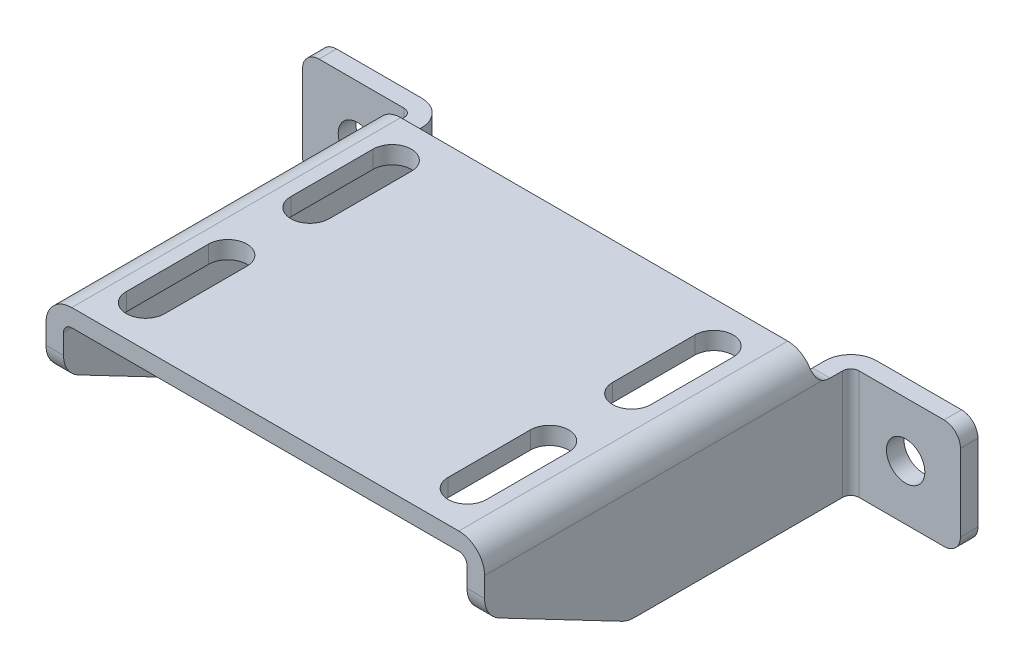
ISO-10303-21;
HEADER;
FILE_DESCRIPTION(('STEP AP214'),'2;1');
FILE_NAME('part.step','',(''),(''),'','','');
FILE_SCHEMA(('AUTOMOTIVE_DESIGN { 1 0 10303 214 1 1 1 1 }'));
ENDSEC;
DATA;
#1=APPLICATION_CONTEXT('core data for automotive mechanical design processes');
#2=APPLICATION_PROTOCOL_DEFINITION('international standard','automotive_design',2000,#1);
#3=PRODUCT_CONTEXT('',#1,'mechanical');
#4=PRODUCT('Part','Part','',(#3));
#5=PRODUCT_RELATED_PRODUCT_CATEGORY('part','',(#4));
#6=PRODUCT_DEFINITION_FORMATION('','',#4);
#7=PRODUCT_DEFINITION_CONTEXT('part definition',#1,'design');
#8=PRODUCT_DEFINITION('design','',#6,#7);
#9=PRODUCT_DEFINITION_SHAPE('','',#8);
#10=(LENGTH_UNIT() NAMED_UNIT(*) SI_UNIT(.MILLI.,.METRE.));
#11=(NAMED_UNIT(*) PLANE_ANGLE_UNIT() SI_UNIT($,.RADIAN.));
#12=(NAMED_UNIT(*) SI_UNIT($,.STERADIAN.) SOLID_ANGLE_UNIT());
#13=UNCERTAINTY_MEASURE_WITH_UNIT(LENGTH_MEASURE(1.E-05),#10,'distance_accuracy_value','');
#14=(GEOMETRIC_REPRESENTATION_CONTEXT(3) GLOBAL_UNCERTAINTY_ASSIGNED_CONTEXT((#13)) GLOBAL_UNIT_ASSIGNED_CONTEXT((#10,
#11,#12)) REPRESENTATION_CONTEXT('',''));
#15=CARTESIAN_POINT('',(0.,0.,0.));
#16=DIRECTION('',(0.,0.,1.));
#17=DIRECTION('',(1.,0.,0.));
#18=AXIS2_PLACEMENT_3D('',#15,#16,#17);
#19=CARTESIAN_POINT('',(90.,10.3,70.));
#20=DIRECTION('',(1.,0.,0.));
#21=DIRECTION('',(0.,0.,1.));
#22=AXIS2_PLACEMENT_3D('',#19,#20,#21);
#23=PLANE('',#22);
#24=DIRECTION('',(0.,0.,-1.));
#25=VECTOR('',#24,1.);
#26=CARTESIAN_POINT('',(90.,-10.,75.6450194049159));
#27=LINE('',#26,#25);
#28=CARTESIAN_POINT('',(90.,-10.,42.6611));
#29=VERTEX_POINT('',#28);
#30=CARTESIAN_POINT('',(90.,-10.,4.7));
#31=VERTEX_POINT('',#30);
#32=EDGE_CURVE('E519',#29,#31,#27,.T.);
#33=ORIENTED_EDGE('',*,*,#32,.T.);
#34=DIRECTION('',(0.,1.,0.));
#35=VECTOR('',#34,1.);
#36=CARTESIAN_POINT('',(90.,10.3,4.7));
#37=LINE('',#36,#35);
#38=CARTESIAN_POINT('',(90.,10.,4.7));
#39=VERTEX_POINT('',#38);
#40=EDGE_CURVE('E522',#31,#39,#37,.T.);
#41=ORIENTED_EDGE('',*,*,#40,.T.);
#42=DIRECTION('',(0.,0.,-1.));
#43=VECTOR('',#42,1.);
#44=CARTESIAN_POINT('',(90.,10.,70.));
#45=LINE('',#44,#43);
#46=CARTESIAN_POINT('',(90.,10.,7.));
#47=VERTEX_POINT('',#46);
#48=EDGE_CURVE('E486',#47,#39,#45,.T.);
#49=ORIENTED_EDGE('',*,*,#48,.F.);
#50=CARTESIAN_POINT('',(90.,13.,7.));
#51=DIRECTION('',(1.,0.,0.));
#52=DIRECTION('',(0.,0.,1.));
#53=AXIS2_PLACEMENT_3D('',#50,#51,#52);
#54=CIRCLE('',#53,3.);
#55=CARTESIAN_POINT('',(90.,10.3,8.3076696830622));
#56=VERTEX_POINT('',#55);
#57=EDGE_CURVE('E461',#47,#56,#54,.F.);
#58=ORIENTED_EDGE('',*,*,#57,.T.);
#59=DIRECTION('',(0.,0.,-1.));
#60=VECTOR('',#59,1.);
#61=CARTESIAN_POINT('',(90.,10.3,70.));
#62=LINE('',#61,#60);
#63=CARTESIAN_POINT('',(90.,10.3,70.));
#64=VERTEX_POINT('',#63);
#65=EDGE_CURVE('E641',#64,#56,#62,.T.);
#66=ORIENTED_EDGE('',*,*,#65,.F.);
#67=DIRECTION('',(0.,-1.,0.));
#68=VECTOR('',#67,1.);
#69=CARTESIAN_POINT('',(90.,10.3,70.));
#70=LINE('',#69,#68);
#71=CARTESIAN_POINT('',(90.,6.6878,70.));
#72=VERTEX_POINT('',#71);
#73=EDGE_CURVE('E719',#64,#72,#70,.T.);
#74=ORIENTED_EDGE('',*,*,#73,.T.);
#75=DIRECTION('',(0.,0.,-1.));
#76=VECTOR('',#75,1.);
#77=CARTESIAN_POINT('',(90.,6.6878,70.));
#78=LINE('',#77,#76);
#79=CARTESIAN_POINT('',(90.,6.6878,69.9980227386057));
#80=VERTEX_POINT('',#79);
#81=EDGE_CURVE('E413',#72,#80,#78,.T.);
#82=ORIENTED_EDGE('',*,*,#81,.T.);
#83=CARTESIAN_POINT('',(90.,6.69154286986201,64.9980279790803));
#84=DIRECTION('',(1.,0.,0.));
#85=DIRECTION('',(0.,0.,1.));
#86=AXIS2_PLACEMENT_3D('',#83,#84,#85);
#87=CIRCLE('',#86,4.99999712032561);
#88=CARTESIAN_POINT('',(90.,2.36194286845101,67.4989348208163));
#89=VERTEX_POINT('',#88);
#90=EDGE_CURVE('E428',#80,#89,#87,.T.);
#91=ORIENTED_EDGE('',*,*,#90,.T.);
#92=DIRECTION('',(0.,-0.998535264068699,-0.0541047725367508));
#93=VECTOR('',#92,1.);
#94=CARTESIAN_POINT('',(90.,10.4118840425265,67.9351144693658));
#95=LINE('',#94,#93);
#96=CARTESIAN_POINT('',(90.,2.356873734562,67.4986606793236));
#97=VERTEX_POINT('',#96);
#98=EDGE_CURVE('E432',#89,#97,#95,.T.);
#99=ORIENTED_EDGE('',*,*,#98,.T.);
#100=DIRECTION('',(0.,0.463584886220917,0.886052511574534));
#101=VECTOR('',#100,1.);
#102=CARTESIAN_POINT('',(90.,5.091390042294,72.7251577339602));
#103=LINE('',#102,#101);
#104=CARTESIAN_POINT('',(90.,-9.33092626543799,45.1597000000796));
#105=VERTEX_POINT('',#104);
#106=EDGE_CURVE('E419',#105,#97,#103,.T.);
#107=ORIENTED_EDGE('',*,*,#106,.F.);
#108=CARTESIAN_POINT('',(90.,-5.00000000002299,42.6610848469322));
#109=DIRECTION('',(1.,0.,0.));
#110=DIRECTION('',(0.,0.,1.));
#111=AXIS2_PLACEMENT_3D('',#108,#109,#110);
#112=CIRCLE('',#111,5.);
#113=EDGE_CURVE('E423',#105,#29,#112,.T.);
#114=ORIENTED_EDGE('',*,*,#113,.T.);
#115=EDGE_LOOP('',(#33,#41,#49,#58,#66,#74,#82,#91,#99,#107,#114));
#116=FACE_BOUND('',#115,.T.);
#117=ADVANCED_FACE('F14',(#116),#23,.T.);
#118=CARTESIAN_POINT('',(10.,10.3,70.));
#119=DIRECTION('',(1.,0.,0.));
#120=DIRECTION('',(0.,0.,1.));
#121=AXIS2_PLACEMENT_3D('',#118,#119,#120);
#122=PLANE('',#121);
#123=DIRECTION('',(0.,0.,1.));
#124=VECTOR('',#123,1.);
#125=CARTESIAN_POINT('',(10.,10.,0.));
#126=LINE('',#125,#124);
#127=CARTESIAN_POINT('',(10.,10.,4.7));
#128=VERTEX_POINT('',#127);
#129=CARTESIAN_POINT('',(10.,10.,7.));
#130=VERTEX_POINT('',#129);
#131=EDGE_CURVE('E435',#128,#130,#126,.T.);
#132=ORIENTED_EDGE('',*,*,#131,.F.);
#133=DIRECTION('',(0.,1.,0.));
#134=VECTOR('',#133,1.);
#135=CARTESIAN_POINT('',(10.,10.3,4.7));
#136=LINE('',#135,#134);
#137=CARTESIAN_POINT('',(10.,-10.,4.7));
#138=VERTEX_POINT('',#137);
#139=EDGE_CURVE('E531',#128,#138,#136,.F.);
#140=ORIENTED_EDGE('',*,*,#139,.T.);
#141=DIRECTION('',(0.,0.,-1.));
#142=VECTOR('',#141,1.);
#143=CARTESIAN_POINT('',(10.,-10.,75.6450194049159));
#144=LINE('',#143,#142);
#145=CARTESIAN_POINT('',(10.,-10.,42.6611));
#146=VERTEX_POINT('',#145);
#147=EDGE_CURVE('E553',#146,#138,#144,.T.);
#148=ORIENTED_EDGE('',*,*,#147,.F.);
#149=CARTESIAN_POINT('',(10.,-5.00000000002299,42.6610848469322));
#150=DIRECTION('',(-1.,0.,0.));
#151=DIRECTION('',(0.,0.,-1.));
#152=AXIS2_PLACEMENT_3D('',#149,#150,#151);
#153=CIRCLE('',#152,5.);
#154=CARTESIAN_POINT('',(10.,-9.33092626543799,45.1597000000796));
#155=VERTEX_POINT('',#154);
#156=EDGE_CURVE('E396',#146,#155,#153,.T.);
#157=ORIENTED_EDGE('',*,*,#156,.T.);
#158=DIRECTION('',(0.,-0.463584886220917,-0.886052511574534));
#159=VECTOR('',#158,1.);
#160=CARTESIAN_POINT('',(10.,2.356873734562,67.4986606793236));
#161=LINE('',#160,#159);
#162=CARTESIAN_POINT('',(10.,2.356873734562,67.4986606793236));
#163=VERTEX_POINT('',#162);
#164=EDGE_CURVE('E392',#163,#155,#161,.T.);
#165=ORIENTED_EDGE('',*,*,#164,.F.);
#166=DIRECTION('',(0.,0.998535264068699,0.0541047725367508));
#167=VECTOR('',#166,1.);
#168=CARTESIAN_POINT('',(10.,2.356873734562,67.4986606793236));
#169=LINE('',#168,#167);
#170=CARTESIAN_POINT('',(10.,2.36194286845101,67.4989348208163));
#171=VERTEX_POINT('',#170);
#172=EDGE_CURVE('E369',#163,#171,#169,.T.);
#173=ORIENTED_EDGE('',*,*,#172,.T.);
#174=CARTESIAN_POINT('',(10.,6.69154286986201,64.9980279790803));
#175=DIRECTION('',(-1.,0.,0.));
#176=DIRECTION('',(0.,0.,-1.));
#177=AXIS2_PLACEMENT_3D('',#174,#175,#176);
#178=CIRCLE('',#177,4.99999712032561);
#179=CARTESIAN_POINT('',(10.,6.6878,69.9980227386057));
#180=VERTEX_POINT('',#179);
#181=EDGE_CURVE('E379',#171,#180,#178,.T.);
#182=ORIENTED_EDGE('',*,*,#181,.T.);
#183=DIRECTION('',(0.,0.,1.));
#184=VECTOR('',#183,1.);
#185=CARTESIAN_POINT('',(10.,6.6878,70.));
#186=LINE('',#185,#184);
#187=CARTESIAN_POINT('',(10.,6.6878,70.));
#188=VERTEX_POINT('',#187);
#189=EDGE_CURVE('E386',#180,#188,#186,.T.);
#190=ORIENTED_EDGE('',*,*,#189,.T.);
#191=DIRECTION('',(0.,-1.,0.));
#192=VECTOR('',#191,1.);
#193=CARTESIAN_POINT('',(10.,10.3,70.));
#194=LINE('',#193,#192);
#195=CARTESIAN_POINT('',(10.,10.3,70.));
#196=VERTEX_POINT('',#195);
#197=EDGE_CURVE('E707',#196,#188,#194,.T.);
#198=ORIENTED_EDGE('',*,*,#197,.F.);
#199=DIRECTION('',(0.,0.,-1.));
#200=VECTOR('',#199,1.);
#201=CARTESIAN_POINT('',(10.,10.3,70.));
#202=LINE('',#201,#200);
#203=CARTESIAN_POINT('',(10.,10.3,8.30766968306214));
#204=VERTEX_POINT('',#203);
#205=EDGE_CURVE('E656',#196,#204,#202,.T.);
#206=ORIENTED_EDGE('',*,*,#205,.T.);
#207=CARTESIAN_POINT('',(10.,13.,7.));
#208=DIRECTION('',(1.,0.,0.));
#209=DIRECTION('',(0.,0.,1.));
#210=AXIS2_PLACEMENT_3D('',#207,#208,#209);
#211=CIRCLE('',#210,3.);
#212=EDGE_CURVE('E437',#204,#130,#211,.T.);
#213=ORIENTED_EDGE('',*,*,#212,.T.);
#214=EDGE_LOOP('',(#132,#140,#148,#157,#165,#173,#182,#190,#198,#206,#213));
#215=FACE_BOUND('',#214,.T.);
#216=ADVANCED_FACE('F389',(#215),#122,.F.);
#217=CARTESIAN_POINT('',(13.2,-10.,70.));
#218=DIRECTION('',(-1.,0.,0.));
#219=DIRECTION('',(0.,0.,-1.));
#220=AXIS2_PLACEMENT_3D('',#217,#218,#219);
#221=PLANE('',#220);
#222=DIRECTION('',(0.,0.,-1.));
#223=VECTOR('',#222,1.);
#224=CARTESIAN_POINT('',(13.2,-10.,70.));
#225=LINE('',#224,#223);
#226=CARTESIAN_POINT('',(13.2,-10.,42.6611));
#227=VERTEX_POINT('',#226);
#228=CARTESIAN_POINT('',(13.2,-10.,4.7));
#229=VERTEX_POINT('',#228);
#230=EDGE_CURVE('E667',#227,#229,#225,.T.);
#231=ORIENTED_EDGE('',*,*,#230,.T.);
#232=DIRECTION('',(0.,1.,0.));
#233=VECTOR('',#232,1.);
#234=CARTESIAN_POINT('',(13.2,-10.,4.7));
#235=LINE('',#234,#233);
#236=CARTESIAN_POINT('',(13.2,10.,4.7));
#237=VERTEX_POINT('',#236);
#238=EDGE_CURVE('E573',#229,#237,#235,.T.);
#239=ORIENTED_EDGE('',*,*,#238,.T.);
#240=DIRECTION('',(0.,0.,1.));
#241=VECTOR('',#240,1.);
#242=CARTESIAN_POINT('',(13.2,10.,70.));
#243=LINE('',#242,#241);
#244=CARTESIAN_POINT('',(13.2,10.,7.));
#245=VERTEX_POINT('',#244);
#246=EDGE_CURVE('E877',#237,#245,#243,.T.);
#247=ORIENTED_EDGE('',*,*,#246,.T.);
#248=CARTESIAN_POINT('',(13.2,13.,7.));
#249=DIRECTION('',(-1.,0.,0.));
#250=DIRECTION('',(0.,0.,-1.));
#251=AXIS2_PLACEMENT_3D('',#248,#249,#250);
#252=CIRCLE('',#251,3.);
#253=CARTESIAN_POINT('',(13.2,13.,10.));
#254=VERTEX_POINT('',#253);
#255=EDGE_CURVE('E450',#254,#245,#252,.F.);
#256=ORIENTED_EDGE('',*,*,#255,.F.);
#257=DIRECTION('',(0.,1.,0.));
#258=VECTOR('',#257,1.);
#259=CARTESIAN_POINT('',(13.2,-10.,10.));
#260=LINE('',#259,#258);
#261=CARTESIAN_POINT('',(13.2,10.3,10.));
#262=VERTEX_POINT('',#261);
#263=EDGE_CURVE('E790',#262,#254,#260,.T.);
#264=ORIENTED_EDGE('',*,*,#263,.F.);
#265=DIRECTION('',(0.,0.,-1.));
#266=VECTOR('',#265,1.);
#267=CARTESIAN_POINT('',(13.2,10.3,70.));
#268=LINE('',#267,#266);
#269=CARTESIAN_POINT('',(13.2,10.3,70.));
#270=VERTEX_POINT('',#269);
#271=EDGE_CURVE('E670',#270,#262,#268,.T.);
#272=ORIENTED_EDGE('',*,*,#271,.F.);
#273=DIRECTION('',(0.,1.,0.));
#274=VECTOR('',#273,1.);
#275=CARTESIAN_POINT('',(13.2,-10.,70.));
#276=LINE('',#275,#274);
#277=CARTESIAN_POINT('',(13.2,6.6878,70.));
#278=VERTEX_POINT('',#277);
#279=EDGE_CURVE('E705',#278,#270,#276,.T.);
#280=ORIENTED_EDGE('',*,*,#279,.F.);
#281=DIRECTION('',(0.,0.,1.));
#282=VECTOR('',#281,1.);
#283=CARTESIAN_POINT('',(13.2,6.6878,70.));
#284=LINE('',#283,#282);
#285=CARTESIAN_POINT('',(13.2,6.6878,69.9980227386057));
#286=VERTEX_POINT('',#285);
#287=EDGE_CURVE('E409',#286,#278,#284,.T.);
#288=ORIENTED_EDGE('',*,*,#287,.F.);
#289=CARTESIAN_POINT('',(13.2,6.69154286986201,64.9980279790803));
#290=DIRECTION('',(-1.,0.,0.));
#291=DIRECTION('',(0.,0.,-1.));
#292=AXIS2_PLACEMENT_3D('',#289,#290,#291);
#293=CIRCLE('',#292,4.99999712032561);
#294=CARTESIAN_POINT('',(13.2,2.36194286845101,67.4989348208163));
#295=VERTEX_POINT('',#294);
#296=EDGE_CURVE('E426',#295,#286,#293,.T.);
#297=ORIENTED_EDGE('',*,*,#296,.F.);
#298=DIRECTION('',(0.,0.998535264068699,0.0541047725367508));
#299=VECTOR('',#298,1.);
#300=CARTESIAN_POINT('',(13.2,-9.82869123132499,66.8383963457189));
#301=LINE('',#300,#299);
#302=CARTESIAN_POINT('',(13.2,2.356873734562,67.4986606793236));
#303=VERTEX_POINT('',#302);
#304=EDGE_CURVE('E372',#303,#295,#301,.T.);
#305=ORIENTED_EDGE('',*,*,#304,.F.);
#306=DIRECTION('',(0.,-0.463584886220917,-0.886052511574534));
#307=VECTOR('',#306,1.);
#308=CARTESIAN_POINT('',(13.2,0.728697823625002,64.3867185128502));
#309=LINE('',#308,#307);
#310=CARTESIAN_POINT('',(13.2,-9.33092626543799,45.1597000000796));
#311=VERTEX_POINT('',#310);
#312=EDGE_CURVE('E416',#303,#311,#309,.T.);
#313=ORIENTED_EDGE('',*,*,#312,.T.);
#314=CARTESIAN_POINT('',(13.2,-5.00000000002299,42.6610848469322));
#315=DIRECTION('',(-1.,0.,0.));
#316=DIRECTION('',(0.,0.,-1.));
#317=AXIS2_PLACEMENT_3D('',#314,#315,#316);
#318=CIRCLE('',#317,5.);
#319=EDGE_CURVE('E421',#227,#311,#318,.T.);
#320=ORIENTED_EDGE('',*,*,#319,.F.);
#321=EDGE_LOOP('',(#231,#239,#247,#256,#264,#272,#280,#288,#297,#305,#313,#320));
#322=FACE_BOUND('',#321,.T.);
#323=ADVANCED_FACE('F515',(#322),#221,.F.);
#324=CARTESIAN_POINT('',(86.8,10.3,70.));
#325=DIRECTION('',(1.,0.,0.));
#326=DIRECTION('',(0.,0.,1.));
#327=AXIS2_PLACEMENT_3D('',#324,#325,#326);
#328=PLANE('',#327);
#329=DIRECTION('',(0.,0.,-1.));
#330=VECTOR('',#329,1.);
#331=CARTESIAN_POINT('',(86.8,10.,70.));
#332=LINE('',#331,#330);
#333=CARTESIAN_POINT('',(86.8,10.,7.));
#334=VERTEX_POINT('',#333);
#335=CARTESIAN_POINT('',(86.8,10.,4.7));
#336=VERTEX_POINT('',#335);
#337=EDGE_CURVE('E485',#334,#336,#332,.T.);
#338=ORIENTED_EDGE('',*,*,#337,.T.);
#339=DIRECTION('',(0.,-1.,0.));
#340=VECTOR('',#339,1.);
#341=CARTESIAN_POINT('',(86.8,10.3,4.7));
#342=LINE('',#341,#340);
#343=CARTESIAN_POINT('',(86.8,-10.,4.7));
#344=VERTEX_POINT('',#343);
#345=EDGE_CURVE('E582',#336,#344,#342,.T.);
#346=ORIENTED_EDGE('',*,*,#345,.T.);
#347=DIRECTION('',(0.,0.,-1.));
#348=VECTOR('',#347,1.);
#349=CARTESIAN_POINT('',(86.8,-10.,70.));
#350=LINE('',#349,#348);
#351=CARTESIAN_POINT('',(86.8,-10.,42.6611));
#352=VERTEX_POINT('',#351);
#353=EDGE_CURVE('E682',#352,#344,#350,.T.);
#354=ORIENTED_EDGE('',*,*,#353,.F.);
#355=CARTESIAN_POINT('',(86.8,-5.00000000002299,42.6610848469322));
#356=DIRECTION('',(1.,0.,0.));
#357=DIRECTION('',(0.,0.,1.));
#358=AXIS2_PLACEMENT_3D('',#355,#356,#357);
#359=CIRCLE('',#358,5.);
#360=CARTESIAN_POINT('',(86.8,-9.33092626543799,45.1597000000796));
#361=VERTEX_POINT('',#360);
#362=EDGE_CURVE('E589',#361,#352,#359,.T.);
#363=ORIENTED_EDGE('',*,*,#362,.F.);
#364=DIRECTION('',(0.,0.463584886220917,0.886052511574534));
#365=VECTOR('',#364,1.);
#366=CARTESIAN_POINT('',(86.8,5.091390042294,72.7251577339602));
#367=LINE('',#366,#365);
#368=CARTESIAN_POINT('',(86.8,2.356873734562,67.4986606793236));
#369=VERTEX_POINT('',#368);
#370=EDGE_CURVE('E591',#361,#369,#367,.T.);
#371=ORIENTED_EDGE('',*,*,#370,.T.);
#372=DIRECTION('',(0.,-0.998535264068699,-0.0541047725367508));
#373=VECTOR('',#372,1.);
#374=CARTESIAN_POINT('',(86.8,10.4118840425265,67.9351144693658));
#375=LINE('',#374,#373);
#376=CARTESIAN_POINT('',(86.8,2.36194286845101,67.4989348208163));
#377=VERTEX_POINT('',#376);
#378=EDGE_CURVE('E587',#377,#369,#375,.T.);
#379=ORIENTED_EDGE('',*,*,#378,.F.);
#380=CARTESIAN_POINT('',(86.8,6.69154286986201,64.9980279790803));
#381=DIRECTION('',(1.,0.,0.));
#382=DIRECTION('',(0.,0.,1.));
#383=AXIS2_PLACEMENT_3D('',#380,#381,#382);
#384=CIRCLE('',#383,4.99999712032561);
#385=CARTESIAN_POINT('',(86.8,6.6878,69.9980227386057));
#386=VERTEX_POINT('',#385);
#387=EDGE_CURVE('E585',#386,#377,#384,.T.);
#388=ORIENTED_EDGE('',*,*,#387,.F.);
#389=DIRECTION('',(0.,0.,-1.));
#390=VECTOR('',#389,1.);
#391=CARTESIAN_POINT('',(86.8,6.6878,70.));
#392=LINE('',#391,#390);
#393=CARTESIAN_POINT('',(86.8,6.6878,70.));
#394=VERTEX_POINT('',#393);
#395=EDGE_CURVE('E411',#394,#386,#392,.T.);
#396=ORIENTED_EDGE('',*,*,#395,.F.);
#397=DIRECTION('',(0.,-1.,0.));
#398=VECTOR('',#397,1.);
#399=CARTESIAN_POINT('',(86.8,10.3,70.));
#400=LINE('',#399,#398);
#401=CARTESIAN_POINT('',(86.8,10.3,70.));
#402=VERTEX_POINT('',#401);
#403=EDGE_CURVE('E693',#402,#394,#400,.T.);
#404=ORIENTED_EDGE('',*,*,#403,.F.);
#405=DIRECTION('',(0.,0.,-1.));
#406=VECTOR('',#405,1.);
#407=CARTESIAN_POINT('',(86.8,10.3,70.));
#408=LINE('',#407,#406);
#409=CARTESIAN_POINT('',(86.8,10.3,10.));
#410=VERTEX_POINT('',#409);
#411=EDGE_CURVE('E679',#402,#410,#408,.T.);
#412=ORIENTED_EDGE('',*,*,#411,.T.);
#413=DIRECTION('',(0.,1.,0.));
#414=VECTOR('',#413,1.);
#415=CARTESIAN_POINT('',(86.8,-10.,10.));
#416=LINE('',#415,#414);
#417=CARTESIAN_POINT('',(86.8,13.,10.));
#418=VERTEX_POINT('',#417);
#419=EDGE_CURVE('E787',#410,#418,#416,.T.);
#420=ORIENTED_EDGE('',*,*,#419,.T.);
#421=CARTESIAN_POINT('',(86.8,13.,7.));
#422=DIRECTION('',(1.,0.,0.));
#423=DIRECTION('',(0.,0.,1.));
#424=AXIS2_PLACEMENT_3D('',#421,#422,#423);
#425=CIRCLE('',#424,3.);
#426=EDGE_CURVE('E448',#334,#418,#425,.F.);
#427=ORIENTED_EDGE('',*,*,#426,.F.);
#428=EDGE_LOOP('',(#338,#346,#354,#363,#371,#379,#388,#396,#404,#412,#420,#427));
#429=FACE_BOUND('',#428,.T.);
#430=ADVANCED_FACE('F882',(#429),#328,.F.);
#431=CARTESIAN_POINT('',(85.3,10.3,70.));
#432=DIRECTION('',(0.,0.,-1.));
#433=DIRECTION('',(1.,0.,0.));
#434=AXIS2_PLACEMENT_3D('',#431,#432,#433);
#435=PLANE('',#434);
#436=DIRECTION('',(-1.,0.,0.));
#437=VECTOR('',#436,1.);
#438=CARTESIAN_POINT('',(85.3,6.6878,70.));
#439=LINE('',#438,#437);
#440=EDGE_CURVE('E594',#72,#394,#439,.T.);
#441=ORIENTED_EDGE('',*,*,#440,.F.);
#442=ORIENTED_EDGE('',*,*,#73,.F.);
#443=CARTESIAN_POINT('',(85.3,10.3,70.));
#444=DIRECTION('',(0.,0.,-1.));
#445=DIRECTION('',(1.,0.,0.));
#446=AXIS2_PLACEMENT_3D('',#443,#444,#445);
#447=CIRCLE('',#446,4.7);
#448=CARTESIAN_POINT('',(85.3,15.,70.));
#449=VERTEX_POINT('',#448);
#450=EDGE_CURVE('E716',#449,#64,#447,.T.);
#451=ORIENTED_EDGE('',*,*,#450,.F.);
#452=DIRECTION('',(1.,0.,0.));
#453=VECTOR('',#452,1.);
#454=CARTESIAN_POINT('',(14.7,15.,70.));
#455=LINE('',#454,#453);
#456=CARTESIAN_POINT('',(14.7,15.,70.));
#457=VERTEX_POINT('',#456);
#458=EDGE_CURVE('E713',#457,#449,#455,.T.);
#459=ORIENTED_EDGE('',*,*,#458,.F.);
#460=CARTESIAN_POINT('',(14.7,10.3,70.));
#461=DIRECTION('',(0.,0.,1.));
#462=DIRECTION('',(-1.,0.,0.));
#463=AXIS2_PLACEMENT_3D('',#460,#461,#462);
#464=CIRCLE('',#463,4.7);
#465=EDGE_CURVE('E710',#457,#196,#464,.T.);
#466=ORIENTED_EDGE('',*,*,#465,.T.);
#467=ORIENTED_EDGE('',*,*,#197,.T.);
#468=EDGE_CURVE('E595',#278,#188,#439,.T.);
#469=ORIENTED_EDGE('',*,*,#468,.F.);
#470=ORIENTED_EDGE('',*,*,#279,.T.);
#471=CARTESIAN_POINT('',(14.7,10.3,70.));
#472=DIRECTION('',(0.,0.,1.));
#473=DIRECTION('',(-1.,0.,0.));
#474=AXIS2_PLACEMENT_3D('',#471,#472,#473);
#475=CIRCLE('',#474,1.5);
#476=CARTESIAN_POINT('',(14.7,11.8,70.));
#477=VERTEX_POINT('',#476);
#478=EDGE_CURVE('E702',#477,#270,#475,.T.);
#479=ORIENTED_EDGE('',*,*,#478,.F.);
#480=DIRECTION('',(1.,0.,0.));
#481=VECTOR('',#480,1.);
#482=CARTESIAN_POINT('',(14.7,11.8,70.));
#483=LINE('',#482,#481);
#484=CARTESIAN_POINT('',(85.3,11.8,70.));
#485=VERTEX_POINT('',#484);
#486=EDGE_CURVE('E699',#477,#485,#483,.T.);
#487=ORIENTED_EDGE('',*,*,#486,.T.);
#488=CARTESIAN_POINT('',(85.3,10.3,70.));
#489=DIRECTION('',(0.,0.,1.));
#490=DIRECTION('',(-1.,0.,0.));
#491=AXIS2_PLACEMENT_3D('',#488,#489,#490);
#492=CIRCLE('',#491,1.5);
#493=EDGE_CURVE('E696',#402,#485,#492,.T.);
#494=ORIENTED_EDGE('',*,*,#493,.F.);
#495=ORIENTED_EDGE('',*,*,#403,.T.);
#496=EDGE_LOOP('',(#441,#442,#451,#459,#466,#467,#469,#470,#479,#487,#494,#495));
#497=FACE_BOUND('',#496,.T.);
#498=ADVANCED_FACE('F491',(#497),#435,.F.);
#499=CARTESIAN_POINT('',(85.3,10.3,70.));
#500=DIRECTION('',(0.,0.,-1.));
#501=DIRECTION('',(1.,0.,0.));
#502=AXIS2_PLACEMENT_3D('',#499,#500,#501);
#503=CYLINDRICAL_SURFACE('',#502,4.7);
#504=CARTESIAN_POINT('',(90.,10.3,8.3076696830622));
#505=CARTESIAN_POINT('',(90.0000017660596,10.3698753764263,8.45193039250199));
#506=CARTESIAN_POINT('',(89.9984682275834,10.4513818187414,8.59067000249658));
#507=CARTESIAN_POINT('',(89.9889152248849,10.6354773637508,8.85331712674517));
#508=CARTESIAN_POINT('',(89.9808897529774,10.7380859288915,8.97721078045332));
#509=CARTESIAN_POINT('',(89.9545777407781,10.9614806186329,9.20683895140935));
#510=CARTESIAN_POINT('',(89.936264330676,11.0823137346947,9.31252496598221));
#511=CARTESIAN_POINT('',(89.8859268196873,11.3373539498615,9.50216303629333));
#512=CARTESIAN_POINT('',(89.8539136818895,11.4715502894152,9.58613238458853));
#513=CARTESIAN_POINT('',(89.7758680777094,11.7405553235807,9.72684283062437));
#514=CARTESIAN_POINT('',(89.7306312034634,11.8749859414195,9.78475129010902));
#515=CARTESIAN_POINT('',(89.625013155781,12.1453491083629,9.87925141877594));
#516=CARTESIAN_POINT('',(89.5646308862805,12.2812817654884,9.91584154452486));
#517=CARTESIAN_POINT('',(89.4298686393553,12.5486565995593,9.96896570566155));
#518=CARTESIAN_POINT('',(89.3555967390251,12.680124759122,9.98564770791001));
#519=CARTESIAN_POINT('',(89.1941607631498,12.9359848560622,10.0020587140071));
#520=CARTESIAN_POINT('',(89.1069913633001,13.0603738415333,10.0017806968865));
#521=CARTESIAN_POINT('',(88.9474318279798,13.266172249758,9.98941903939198));
#522=CARTESIAN_POINT('',(88.8776978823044,13.3498948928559,9.98064877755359));
#523=CARTESIAN_POINT('',(88.7330419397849,13.5118562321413,9.95714416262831));
#524=CARTESIAN_POINT('',(88.6581180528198,13.5900929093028,9.94240762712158));
#525=CARTESIAN_POINT('',(88.4260511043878,13.8163176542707,9.8909453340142));
#526=CARTESIAN_POINT('',(88.2618281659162,13.9555443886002,9.84699079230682));
#527=CARTESIAN_POINT('',(87.9809089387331,14.1627982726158,9.76683578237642));
#528=CARTESIAN_POINT('',(87.8686651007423,14.2382979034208,9.73363436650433));
#529=CARTESIAN_POINT('',(87.6384731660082,14.3791826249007,9.66532809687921));
#530=CARTESIAN_POINT('',(87.5205239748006,14.4445657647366,9.63022287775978));
#531=CARTESIAN_POINT('',(87.2793969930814,14.5649921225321,9.56039956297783));
#532=CARTESIAN_POINT('',(87.1562202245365,14.6200373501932,9.52568139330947));
#533=CARTESIAN_POINT('',(86.9049374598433,14.7195500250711,9.45901079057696));
#534=CARTESIAN_POINT('',(86.776832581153,14.7640198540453,9.4270577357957));
#535=CARTESIAN_POINT('',(86.5466805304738,14.832840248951,9.37530903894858));
#536=CARTESIAN_POINT('',(86.4455567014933,14.8594636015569,9.35441870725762));
#537=CARTESIAN_POINT('',(86.2410446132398,14.906020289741,9.31689064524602));
#538=CARTESIAN_POINT('',(86.1376576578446,14.9259573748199,9.30025053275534));
#539=CARTESIAN_POINT('',(85.9293474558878,14.9588633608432,9.27229447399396));
#540=CARTESIAN_POINT('',(85.8244291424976,14.971851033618,9.26096419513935));
#541=CARTESIAN_POINT('',(85.6134718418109,14.9907299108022,9.24436068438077));
#542=CARTESIAN_POINT('',(85.5074328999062,14.9966214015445,9.23908720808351));
#543=CARTESIAN_POINT('',(85.2946614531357,15.0012059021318,9.23499111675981));
#544=CARTESIAN_POINT('',(85.1879278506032,14.9998710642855,9.23619345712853));
#545=CARTESIAN_POINT('',(84.9750706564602,14.9899654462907,9.24501225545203));
#546=CARTESIAN_POINT('',(84.8689470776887,14.9813945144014,9.25262884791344));
#547=CARTESIAN_POINT('',(84.6578604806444,14.9571416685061,9.27373091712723));
#548=CARTESIAN_POINT('',(84.552900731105,14.9414432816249,9.28722998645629));
#549=CARTESIAN_POINT('',(84.3449940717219,14.903168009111,9.3191746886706));
#550=CARTESIAN_POINT('',(84.2420483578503,14.8805871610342,9.33762317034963));
#551=CARTESIAN_POINT('',(83.8839265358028,14.7893967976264,9.40934595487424));
#552=CARTESIAN_POINT('',(83.6350810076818,14.7029769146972,9.47294866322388));
#553=CARTESIAN_POINT('',(83.2765897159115,14.544169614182,9.57283301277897));
#554=CARTESIAN_POINT('',(83.1594498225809,14.4863011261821,9.60690948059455));
#555=CARTESIAN_POINT('',(82.9302439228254,14.3609491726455,9.67448860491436));
#556=CARTESIAN_POINT('',(82.8181774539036,14.2934665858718,9.70799131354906));
#557=CARTESIAN_POINT('',(82.5224079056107,14.098005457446,9.7950943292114));
#558=CARTESIAN_POINT('',(82.3438080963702,13.9608806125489,9.84624090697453));
#559=CARTESIAN_POINT('',(82.0905943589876,13.7354716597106,9.90949516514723));
#560=CARTESIAN_POINT('',(82.0086877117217,13.6571078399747,9.9283274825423));
#561=CARTESIAN_POINT('',(81.850239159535,13.4940701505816,9.96020282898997));
#562=CARTESIAN_POINT('',(81.7736955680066,13.4093982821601,9.97324768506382));
#563=CARTESIAN_POINT('',(81.5897621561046,13.1902390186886,9.99687326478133));
#564=CARTESIAN_POINT('',(81.4860795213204,13.052007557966,10.0029626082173));
#565=CARTESIAN_POINT('',(81.3427099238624,12.8371877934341,9.99643860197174));
#566=CARTESIAN_POINT('',(81.2969344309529,12.7643138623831,9.99165065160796));
#567=CARTESIAN_POINT('',(81.2096985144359,12.6166284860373,9.9763278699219));
#568=CARTESIAN_POINT('',(81.1682359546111,12.5418180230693,9.96579589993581));
#569=CARTESIAN_POINT('',(81.0895431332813,12.3903120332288,9.93841058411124));
#570=CARTESIAN_POINT('',(81.0523512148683,12.313605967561,9.92150504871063));
#571=CARTESIAN_POINT('',(80.9827937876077,12.1597980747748,9.88103790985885));
#572=CARTESIAN_POINT('',(80.9504260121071,12.0826964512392,9.85747944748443));
#573=CARTESIAN_POINT('',(80.8905654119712,11.9290140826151,9.803501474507));
#574=CARTESIAN_POINT('',(80.8630718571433,11.8524332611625,9.77308299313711));
#575=CARTESIAN_POINT('',(80.8128828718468,11.7007711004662,9.70534662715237));
#576=CARTESIAN_POINT('',(80.7901869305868,11.6256896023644,9.66802947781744));
#577=CARTESIAN_POINT('',(80.7518491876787,11.4869536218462,9.59155943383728));
#578=CARTESIAN_POINT('',(80.7356858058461,11.4230171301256,9.55317726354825));
#579=CARTESIAN_POINT('',(80.7066556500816,11.2976643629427,9.47136949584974));
#580=CARTESIAN_POINT('',(80.6937899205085,11.2362488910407,9.42794230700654));
#581=CARTESIAN_POINT('',(80.6597206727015,11.0567068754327,9.29047099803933));
#582=CARTESIAN_POINT('',(80.643011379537,10.9431566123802,9.18916695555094));
#583=CARTESIAN_POINT('',(80.618725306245,10.7324075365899,8.97007029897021));
#584=CARTESIAN_POINT('',(80.6111457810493,10.6352038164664,8.85228265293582));
#585=CARTESIAN_POINT('',(80.6018915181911,10.4597014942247,8.60315452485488));
#586=CARTESIAN_POINT('',(80.6002183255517,10.3814078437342,8.4718105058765));
#587=CARTESIAN_POINT('',(80.5998066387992,10.2408788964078,8.18907581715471));
#588=CARTESIAN_POINT('',(80.6012841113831,10.1801713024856,8.03692431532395));
#589=CARTESIAN_POINT('',(80.6047064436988,10.0842894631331,7.72477648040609));
#590=CARTESIAN_POINT('',(80.6066513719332,10.0491189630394,7.56477900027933));
#591=CARTESIAN_POINT('',(80.6092384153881,10.0045502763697,7.23595651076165));
#592=CARTESIAN_POINT('',(80.6098366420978,9.99601688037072,7.06701306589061));
#593=CARTESIAN_POINT('',(80.609112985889,10.0074146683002,6.73009087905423));
#594=CARTESIAN_POINT('',(80.6077909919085,10.0273474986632,6.56211219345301));
#595=CARTESIAN_POINT('',(80.6043486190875,10.0950780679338,6.23201932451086));
#596=CARTESIAN_POINT('',(80.6022288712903,10.1428537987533,6.06990061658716));
#597=CARTESIAN_POINT('',(80.5997366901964,10.2649257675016,5.75591663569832));
#598=CARTESIAN_POINT('',(80.5993645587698,10.33922658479,5.60405313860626));
#599=CARTESIAN_POINT('',(80.6039992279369,10.5122249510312,5.31496508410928));
#600=CARTESIAN_POINT('',(80.6090060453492,10.6109225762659,5.17774057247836));
#601=CARTESIAN_POINT('',(80.6286424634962,10.8295383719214,4.92218203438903));
#602=CARTESIAN_POINT('',(80.6432672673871,10.9494459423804,4.80383862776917));
#603=CARTESIAN_POINT('',(80.6853379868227,11.200159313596,4.59458378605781));
#604=CARTESIAN_POINT('',(80.7121809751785,11.3302374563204,4.50268188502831));
#605=CARTESIAN_POINT('',(80.7812681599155,11.6001555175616,4.341979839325));
#606=CARTESIAN_POINT('',(80.8235036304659,11.7399898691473,4.27316664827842));
#607=CARTESIAN_POINT('',(80.9213874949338,12.0139189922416,4.1630963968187));
#608=CARTESIAN_POINT('',(80.9759796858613,12.1477921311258,4.12033310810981));
#609=CARTESIAN_POINT('',(81.0995540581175,12.4137069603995,4.05465915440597));
#610=CARTESIAN_POINT('',(81.1685389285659,12.5457483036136,4.03175220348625));
#611=CARTESIAN_POINT('',(81.3225002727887,12.8087008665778,4.00307480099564));
#612=CARTESIAN_POINT('',(81.407974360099,12.9393891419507,3.99797039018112));
#613=CARTESIAN_POINT('',(81.5913250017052,13.1913748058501,4.0034547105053));
#614=CARTESIAN_POINT('',(81.6892086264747,13.312666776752,4.01405242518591));
#615=CARTESIAN_POINT('',(81.8710724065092,13.5165935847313,4.04346597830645));
#616=CARTESIAN_POINT('',(81.9528664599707,13.6015870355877,4.05974571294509));
#617=CARTESIAN_POINT('',(82.1219216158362,13.7646238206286,4.09786882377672));
#618=CARTESIAN_POINT('',(82.2091851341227,13.8426640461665,4.11971467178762));
#619=CARTESIAN_POINT('',(82.478675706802,14.0662533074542,4.19151004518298));
#620=CARTESIAN_POINT('',(82.6683720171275,14.2010141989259,4.24767214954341));
#621=CARTESIAN_POINT('',(82.9676774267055,14.3822046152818,4.33650327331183));
#622=CARTESIAN_POINT('',(83.0713927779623,14.4397288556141,4.36732150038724));
#623=CARTESIAN_POINT('',(83.2829088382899,14.5468106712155,4.42877788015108));
#624=CARTESIAN_POINT('',(83.3907098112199,14.5963677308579,4.45941602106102));
#625=CARTESIAN_POINT('',(83.719741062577,14.7327217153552,4.54858064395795));
#626=CARTESIAN_POINT('',(83.9470159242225,14.8074537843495,4.60449342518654));
#627=CARTESIAN_POINT('',(84.2794646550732,14.889000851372,4.66919802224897));
#628=CARTESIAN_POINT('',(84.3796424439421,14.9101519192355,4.68659065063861));
#629=CARTESIAN_POINT('',(84.5818452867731,14.9459421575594,4.71661280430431));
#630=CARTESIAN_POINT('',(84.6838693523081,14.9605847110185,4.72924480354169));
#631=CARTESIAN_POINT('',(84.889015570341,14.983131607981,4.74890805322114));
#632=CARTESIAN_POINT('',(84.9921354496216,14.9910478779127,4.75594921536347));
#633=CARTESIAN_POINT('',(85.1989127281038,15.0000520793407,4.76397030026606));
#634=CARTESIAN_POINT('',(85.3025701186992,15.0011401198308,4.76495031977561));
#635=CARTESIAN_POINT('',(85.5096501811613,14.9964639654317,4.76077190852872));
#636=CARTESIAN_POINT('',(85.6130727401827,14.9906969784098,4.75561097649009));
#637=CARTESIAN_POINT('',(85.8188398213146,14.9724179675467,4.7395338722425));
#638=CARTESIAN_POINT('',(85.9211843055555,14.9599057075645,4.72861749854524));
#639=CARTESIAN_POINT('',(86.2261723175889,14.9124328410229,4.68820978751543));
#640=CARTESIAN_POINT('',(86.4263584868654,14.8675464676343,4.65107283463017));
#641=CARTESIAN_POINT('',(86.7506094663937,14.7725778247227,4.57921875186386));
#642=CARTESIAN_POINT('',(86.877589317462,14.729346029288,4.54790486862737));
#643=CARTESIAN_POINT('',(87.1268209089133,14.6325025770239,4.48238951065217));
#644=CARTESIAN_POINT('',(87.2490715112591,14.5788884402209,4.4481873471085));
#645=CARTESIAN_POINT('',(87.4884825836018,14.4615289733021,4.37920577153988));
#646=CARTESIAN_POINT('',(87.6056415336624,14.3977806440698,4.34442619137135));
#647=CARTESIAN_POINT('',(87.8344223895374,14.2603693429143,4.27651825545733));
#648=CARTESIAN_POINT('',(87.946045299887,14.1867081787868,4.24338960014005));
#649=CARTESIAN_POINT('',(88.2272280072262,13.9832823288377,4.16254318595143));
#650=CARTESIAN_POINT('',(88.3923436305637,13.845962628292,4.11767384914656));
#651=CARTESIAN_POINT('',(88.6260258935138,13.6225254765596,4.06430169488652));
#652=CARTESIAN_POINT('',(88.7015477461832,13.5451875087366,4.04883796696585));
#653=CARTESIAN_POINT('',(88.847513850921,13.38494226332,4.02369557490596));
#654=CARTESIAN_POINT('',(88.9179594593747,13.3020364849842,4.01401536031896));
#655=CARTESIAN_POINT('',(89.0378804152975,13.1505031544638,4.00304384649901));
#656=CARTESIAN_POINT('',(89.0884994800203,13.0828778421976,4.00035201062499));
#657=CARTESIAN_POINT('',(89.1860235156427,12.9449851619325,3.99971268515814));
#658=CARTESIAN_POINT('',(89.2329294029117,12.874718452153,4.0017640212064));
#659=CARTESIAN_POINT('',(89.3227407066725,12.732008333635,4.01113850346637));
#660=CARTESIAN_POINT('',(89.365646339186,12.6595650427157,4.01846136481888));
#661=CARTESIAN_POINT('',(89.4471763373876,12.5131304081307,4.03884840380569));
#662=CARTESIAN_POINT('',(89.4858027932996,12.4391398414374,4.051909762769));
#663=CARTESIAN_POINT('',(89.558861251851,12.289740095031,4.08428139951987));
#664=CARTESIAN_POINT('',(89.5932599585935,12.2143244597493,4.10363738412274));
#665=CARTESIAN_POINT('',(89.657387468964,12.063487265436,4.14883553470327));
#666=CARTESIAN_POINT('',(89.6871183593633,11.9880657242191,4.17467478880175));
#667=CARTESIAN_POINT('',(89.7419196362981,11.8380911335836,4.23297275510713));
#668=CARTESIAN_POINT('',(89.7669901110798,11.7635380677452,4.2654313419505));
#669=CARTESIAN_POINT('',(89.8125910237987,11.6162321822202,4.3369399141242));
#670=CARTESIAN_POINT('',(89.833121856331,11.5434792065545,4.37598932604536));
#671=CARTESIAN_POINT('',(89.8678814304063,11.4084995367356,4.45587278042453));
#672=CARTESIAN_POINT('',(89.882554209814,11.3459929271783,4.49604245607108));
#673=CARTESIAN_POINT('',(89.9087637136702,11.2236960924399,4.58125842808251));
#674=CARTESIAN_POINT('',(89.9202993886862,11.1639067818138,4.62630634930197));
#675=CARTESIAN_POINT('',(89.9506461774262,10.9894811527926,4.76835722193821));
#676=CARTESIAN_POINT('',(89.9652266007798,10.8796661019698,4.8723385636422));
#677=CARTESIAN_POINT('',(89.9861339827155,10.6753514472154,5.09750805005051));
#678=CARTESIAN_POINT('',(89.9923492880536,10.5810734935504,5.21890548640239));
#679=CARTESIAN_POINT('',(89.9994246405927,10.4120963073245,5.47478972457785));
#680=CARTESIAN_POINT('',(90.0002834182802,10.3374017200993,5.60927962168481));
#681=CARTESIAN_POINT('',(89.999541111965,10.2049506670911,5.89789106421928));
#682=CARTESIAN_POINT('',(89.9977631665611,10.1487507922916,6.05272796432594));
#683=CARTESIAN_POINT('',(89.9941905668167,10.0623982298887,6.3695507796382));
#684=CARTESIAN_POINT('',(89.9923959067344,10.0322548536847,6.53153922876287));
#685=CARTESIAN_POINT('',(89.9903458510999,9.99839636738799,6.86274187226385));
#686=CARTESIAN_POINT('',(89.9901338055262,9.99542505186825,7.03203261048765));
#687=CARTESIAN_POINT('',(89.9915444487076,10.0179633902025,7.36856961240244));
#688=CARTESIAN_POINT('',(89.9931651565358,10.0434422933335,7.53581788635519));
#689=CARTESIAN_POINT('',(89.996133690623,10.1078694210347,7.80451294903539));
#690=CARTESIAN_POINT('',(89.9973699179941,10.1386740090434,7.90798556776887));
#691=CARTESIAN_POINT('',(89.9993024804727,10.2112302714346,8.11102863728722));
#692=CARTESIAN_POINT('',(89.9999988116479,10.2529820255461,8.21059905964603));
#693=CARTESIAN_POINT('',(90.,10.3,8.3076696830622));
#694=B_SPLINE_CURVE_WITH_KNOTS('',3,(#504,#505,#506,#507,#508,#509,#510,#511,#512,#513,#514,
#515,#516,#517,#518,#519,#520,#521,#522,#523,#524,#525,#526,#527,#528,#529,#530,#531,#532,#533,
#534,#535,#536,#537,#538,#539,#540,#541,#542,#543,#544,#545,#546,#547,#548,#549,#550,#551,#552,
#553,#554,#555,#556,#557,#558,#559,#560,#561,#562,#563,#564,#565,#566,#567,#568,#569,#570,#571,
#572,#573,#574,#575,#576,#577,#578,#579,#580,#581,#582,#583,#584,#585,#586,#587,#588,#589,#590,
#591,#592,#593,#594,#595,#596,#597,#598,#599,#600,#601,#602,#603,#604,#605,#606,#607,#608,#609,
#610,#611,#612,#613,#614,#615,#616,#617,#618,#619,#620,#621,#622,#623,#624,#625,#626,#627,#628,
#629,#630,#631,#632,#633,#634,#635,#636,#637,#638,#639,#640,#641,#642,#643,#644,#645,#646,#647,
#648,#649,#650,#651,#652,#653,#654,#655,#656,#657,#658,#659,#660,#661,#662,#663,#664,#665,#666,
#667,#668,#669,#670,#671,#672,#673,#674,#675,#676,#677,#678,#679,#680,#681,#682,#683,#684,#685,
#686,#687,#688,#689,#690,#691,#692,#693),.UNSPECIFIED.,.T.,.F.,(4,2,2,2,2,2,2,2,2,2,2,2,2,2,2,2,
2,2,2,2,2,2,2,2,2,2,2,2,2,2,2,2,2,2,2,2,2,2,2,2,2,2,2,2,2,2,2,2,2,2,2,2,2,2,2,2,2,2,2,2,2,2,2,2,
2,2,2,2,2,2,2,2,2,2,2,2,2,2,2,2,2,2,2,2,2,2,2,2,2,2,2,2,2,2,4),(0.,0.480511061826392,
0.961467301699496,1.4436855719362,1.92551867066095,2.38285244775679,2.84021933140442,
3.29416523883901,3.74829906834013,4.07580669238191,4.40343422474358,5.05972919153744,
5.47719413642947,5.89473948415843,6.31220357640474,6.72957355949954,7.04920100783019,
7.36864891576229,7.68722951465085,8.00579725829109,8.32559352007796,8.64539648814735,
8.96594237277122,9.2866731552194,10.0946651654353,10.4994412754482,10.9041804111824,
11.5938254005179,11.9381840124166,12.2824338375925,12.7987663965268,13.0570804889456,
13.3152660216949,13.5756133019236,13.835837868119,14.0960234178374,14.3561812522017,
14.5848064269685,14.8135039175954,15.270454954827,15.7272685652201,16.1842016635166,
16.6734572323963,17.1627845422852,17.6678412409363,18.172927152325,18.6776143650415,
19.1823887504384,19.6871647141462,20.191689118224,20.6736397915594,21.1553176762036,
21.6055358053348,22.0558381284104,22.5228167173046,22.9900625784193,23.3468131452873,
23.7037224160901,24.4185728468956,24.7859331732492,25.1533172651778,25.8865822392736,
26.1978968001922,26.509049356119,26.8196490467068,27.1302437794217,27.4409650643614,
27.7516972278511,28.3743829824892,28.7871927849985,29.2001013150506,29.6131322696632,
30.0260880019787,30.6813997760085,31.0086703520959,31.3358531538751,31.5891685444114,
31.8424212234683,32.0956602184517,32.3487749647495,32.6037702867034,32.8586512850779,
33.1135274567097,33.3683814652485,33.5953107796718,33.8223159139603,34.2759009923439,
34.735482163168,35.1951722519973,35.6871231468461,36.1792497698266,36.6848085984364,
37.1898215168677,37.5131470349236,37.8364749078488),.UNSPECIFIED.);
#695=CARTESIAN_POINT('',(89.1470768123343,13.,10.));
#696=VERTEX_POINT('',#695);
#697=EDGE_CURVE('E479',#56,#696,#694,.T.);
#698=ORIENTED_EDGE('',*,*,#697,.T.);
#699=CARTESIAN_POINT('',(85.3,10.3,10.));
#700=DIRECTION('',(0.,0.,1.));
#701=DIRECTION('',(-1.,0.,0.));
#702=AXIS2_PLACEMENT_3D('',#699,#700,#701);
#703=CIRCLE('',#702,4.7);
#704=CARTESIAN_POINT('',(85.3,15.,10.));
#705=VERTEX_POINT('',#704);
#706=EDGE_CURVE('E526',#705,#696,#703,.F.);
#707=ORIENTED_EDGE('',*,*,#706,.F.);
#708=DIRECTION('',(0.,0.,-1.));
#709=VECTOR('',#708,1.);
#710=CARTESIAN_POINT('',(85.3,15.,70.));
#711=LINE('',#710,#709);
#712=EDGE_CURVE('E650',#449,#705,#711,.T.);
#713=ORIENTED_EDGE('',*,*,#712,.F.);
#714=ORIENTED_EDGE('',*,*,#450,.T.);
#715=ORIENTED_EDGE('',*,*,#65,.T.);
#716=EDGE_LOOP('',(#698,#707,#713,#714,#715));
#717=FACE_BOUND('',#716,.T.);
#718=ADVANCED_FACE('F488',(#717),#503,.T.);
#719=CARTESIAN_POINT('',(14.7,10.3,70.));
#720=DIRECTION('',(0.,0.,-1.));
#721=DIRECTION('',(1.,0.,0.));
#722=AXIS2_PLACEMENT_3D('',#719,#720,#721);
#723=CYLINDRICAL_SURFACE('',#722,4.7);
#724=CARTESIAN_POINT('',(14.7,10.3,10.));
#725=DIRECTION('',(0.,0.,1.));
#726=DIRECTION('',(-1.,0.,0.));
#727=AXIS2_PLACEMENT_3D('',#724,#725,#726);
#728=CIRCLE('',#727,4.7);
#729=CARTESIAN_POINT('',(14.7,15.,10.));
#730=VERTEX_POINT('',#729);
#731=CARTESIAN_POINT('',(10.8529231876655,13.,10.));
#732=VERTEX_POINT('',#731);
#733=EDGE_CURVE('E778',#730,#732,#728,.T.);
#734=ORIENTED_EDGE('',*,*,#733,.T.);
#735=CARTESIAN_POINT('',(19.4,10.3,8.3076696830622));
#736=CARTESIAN_POINT('',(19.4000052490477,10.2265599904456,8.15602043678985));
#737=CARTESIAN_POINT('',(19.3983199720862,10.1658894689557,7.99809904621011));
#738=CARTESIAN_POINT('',(19.394698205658,10.0718819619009,7.67424122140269));
#739=CARTESIAN_POINT('',(19.3927615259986,10.0385658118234,7.5082987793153));
#740=CARTESIAN_POINT('',(19.3904728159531,10.0002628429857,7.17319678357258));
#741=CARTESIAN_POINT('',(19.3901203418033,9.99526809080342,7.00403814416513));
#742=CARTESIAN_POINT('',(19.3912829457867,10.0137391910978,6.66731881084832));
#743=CARTESIAN_POINT('',(19.3927977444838,10.0372007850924,6.49975788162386));
#744=CARTESIAN_POINT('',(19.3963800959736,10.1118673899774,6.17110826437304));
#745=CARTESIAN_POINT('',(19.3984471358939,10.163046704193,6.01001372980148));
#746=CARTESIAN_POINT('',(19.4004307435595,10.2917134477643,5.69862967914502));
#747=CARTESIAN_POINT('',(19.4003468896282,10.3692060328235,5.54834228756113));
#748=CARTESIAN_POINT('',(19.3942936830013,10.5481716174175,5.2630921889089));
#749=CARTESIAN_POINT('',(19.3883304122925,10.6496197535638,5.12811380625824));
#750=CARTESIAN_POINT('',(19.3662611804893,10.8732107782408,4.87752096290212));
#751=CARTESIAN_POINT('',(19.3501608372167,10.9953421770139,4.76189582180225));
#752=CARTESIAN_POINT('',(19.3048617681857,11.2492248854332,4.55870373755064));
#753=CARTESIAN_POINT('',(19.276335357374,11.380223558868,4.47004890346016));
#754=CARTESIAN_POINT('',(19.2037754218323,11.6511522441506,4.31580970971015));
#755=CARTESIAN_POINT('',(19.1597499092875,11.7910776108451,4.25021346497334));
#756=CARTESIAN_POINT('',(19.0583676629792,12.064823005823,4.14595549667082));
#757=CARTESIAN_POINT('',(19.0020161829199,12.1984779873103,4.10586652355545));
#758=CARTESIAN_POINT('',(18.8750809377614,12.4633965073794,4.04525152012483));
#759=CARTESIAN_POINT('',(18.8044940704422,12.5946595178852,4.0247297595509));
#760=CARTESIAN_POINT('',(18.6467987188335,12.8568076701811,4.00039375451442));
#761=CARTESIAN_POINT('',(18.5590771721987,12.9873946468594,3.99739599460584));
#762=CARTESIAN_POINT('',(18.3713009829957,13.2387412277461,4.0068669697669));
#763=CARTESIAN_POINT('',(18.2712394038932,13.3594952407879,4.01934443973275));
#764=CARTESIAN_POINT('',(18.0849216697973,13.5629326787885,4.05192540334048));
#765=CARTESIAN_POINT('',(18.0007837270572,13.647984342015,4.06961476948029));
#766=CARTESIAN_POINT('',(17.8269916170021,13.8108569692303,4.11043832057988));
#767=CARTESIAN_POINT('',(17.7373349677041,13.8886746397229,4.13357496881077));
#768=CARTESIAN_POINT('',(17.4605492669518,14.1112312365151,4.20899515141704));
#769=CARTESIAN_POINT('',(17.2658697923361,14.2447863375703,4.26723335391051));
#770=CARTESIAN_POINT('',(16.9588137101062,14.4233863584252,4.35829273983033));
#771=CARTESIAN_POINT('',(16.8524227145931,14.4799011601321,4.38971029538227));
#772=CARTESIAN_POINT('',(16.6354990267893,14.5846659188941,4.45195386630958));
#773=CARTESIAN_POINT('',(16.524966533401,14.6329162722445,4.48277990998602));
#774=CARTESIAN_POINT('',(16.1877244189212,14.7648367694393,4.57170836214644));
#775=CARTESIAN_POINT('',(15.9548470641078,14.8359813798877,4.6264326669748));
#776=CARTESIAN_POINT('',(15.6169881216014,14.9107969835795,4.68706996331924));
#777=CARTESIAN_POINT('',(15.5169081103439,14.9295899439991,4.70280700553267));
#778=CARTESIAN_POINT('',(15.3151067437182,14.9606917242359,4.7292931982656));
#779=CARTESIAN_POINT('',(15.2133862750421,14.9730039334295,4.74004495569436));
#780=CARTESIAN_POINT('',(15.0090714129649,14.9909462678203,4.75583484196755));
#781=CARTESIAN_POINT('',(14.9064785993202,14.9965866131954,4.76088170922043));
#782=CARTESIAN_POINT('',(14.7010207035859,15.001122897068,4.76493471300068));
#783=CARTESIAN_POINT('',(14.5981556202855,15.0000188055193,4.76394082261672));
#784=CARTESIAN_POINT('',(14.393058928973,14.9910883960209,4.75598514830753));
#785=CARTESIAN_POINT('',(14.2908267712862,14.9832691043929,4.74902960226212));
#786=CARTESIAN_POINT('',(14.0876304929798,14.96105807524,4.72965608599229));
#787=CARTESIAN_POINT('',(13.9866664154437,14.9466661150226,4.71723793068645));
#788=CARTESIAN_POINT('',(13.6860061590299,14.8938263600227,4.67286168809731));
#789=CARTESIAN_POINT('',(13.4889631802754,14.8457341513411,4.63380356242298));
#790=CARTESIAN_POINT('',(13.1679174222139,14.7453471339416,4.55945527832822));
#791=CARTESIAN_POINT('',(13.0410716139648,14.6995508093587,4.52709831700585));
#792=CARTESIAN_POINT('',(12.7922877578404,14.597521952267,4.4599872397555));
#793=CARTESIAN_POINT('',(12.6703509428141,14.5412868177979,4.42523252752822));
#794=CARTESIAN_POINT('',(12.3124585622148,14.3572931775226,4.32089631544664));
#795=CARTESIAN_POINT('',(12.0841609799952,14.2141644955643,4.25117328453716));
#796=CARTESIAN_POINT('',(11.7021059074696,13.9257253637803,4.14325277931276));
#797=CARTESIAN_POINT('',(11.5432792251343,13.7884839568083,4.10149274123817));
#798=CARTESIAN_POINT('',(11.3186293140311,13.5661040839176,4.05292158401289));
#799=CARTESIAN_POINT('',(11.2460468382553,13.489270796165,4.0390797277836));
#800=CARTESIAN_POINT('',(11.1058538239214,13.3303992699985,4.01717221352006));
#801=CARTESIAN_POINT('',(11.0382420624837,13.2483623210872,4.00910513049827));
#802=CARTESIAN_POINT('',(10.9224798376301,13.0977370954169,4.00085791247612));
#803=CARTESIAN_POINT('',(10.8732647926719,13.0300364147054,3.99935764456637));
#804=CARTESIAN_POINT('',(10.7785526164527,12.8921498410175,4.00114695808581));
#805=CARTESIAN_POINT('',(10.7330546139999,12.8219645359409,4.00443541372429));
#806=CARTESIAN_POINT('',(10.6460506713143,12.6795911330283,4.01630432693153));
#807=CARTESIAN_POINT('',(10.6045444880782,12.6074031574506,4.02488446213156));
#808=CARTESIAN_POINT('',(10.5257860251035,12.4616645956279,4.04777505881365));
#809=CARTESIAN_POINT('',(10.4885316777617,12.3881146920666,4.06208271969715));
#810=CARTESIAN_POINT('',(10.4181947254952,12.2398257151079,4.09690257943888));
#811=CARTESIAN_POINT('',(10.3851429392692,12.1650819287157,4.11745724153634));
#812=CARTESIAN_POINT('',(10.3236277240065,12.0157744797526,4.16496314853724));
#813=CARTESIAN_POINT('',(10.2951622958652,11.9412107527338,4.1919115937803));
#814=CARTESIAN_POINT('',(10.2427840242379,11.7931160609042,4.25230538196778));
#815=CARTESIAN_POINT('',(10.2188713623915,11.7195851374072,4.28575098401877));
#816=CARTESIAN_POINT('',(10.175457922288,11.5744629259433,4.35908103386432));
#817=CARTESIAN_POINT('',(10.1559568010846,11.5028714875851,4.39896498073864));
#818=CARTESIAN_POINT('',(10.1228995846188,11.3697469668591,4.48053140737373));
#819=CARTESIAN_POINT('',(10.1089373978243,11.307938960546,4.52160216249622));
#820=CARTESIAN_POINT('',(10.0840712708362,11.1871364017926,4.6085412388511));
#821=CARTESIAN_POINT('',(10.0731683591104,11.1281428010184,4.65441116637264));
#822=CARTESIAN_POINT('',(10.0445905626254,10.9562230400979,4.79879462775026));
#823=CARTESIAN_POINT('',(10.0310188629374,10.8482397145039,4.90415395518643));
#824=CARTESIAN_POINT('',(10.0117246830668,10.6471694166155,5.13242939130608));
#825=CARTESIAN_POINT('',(10.0061602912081,10.5544136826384,5.25564758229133));
#826=CARTESIAN_POINT('',(10.00010815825,10.3888173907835,5.51494256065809));
#827=CARTESIAN_POINT('',(9.99962186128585,10.3159825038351,5.65102299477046));
#828=CARTESIAN_POINT('',(10.000870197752,10.1877188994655,5.94256558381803));
#829=CARTESIAN_POINT('',(10.0027618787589,10.1338558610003,6.09871753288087));
#830=CARTESIAN_POINT('',(10.0063461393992,10.0524439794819,6.41774262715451));
#831=CARTESIAN_POINT('',(10.0080386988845,10.0248977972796,6.58061645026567));
#832=CARTESIAN_POINT('',(10.0097834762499,9.99653491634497,6.91267980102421));
#833=CARTESIAN_POINT('',(10.0097949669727,9.99638184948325,7.08192674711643));
#834=CARTESIAN_POINT('',(10.008062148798,10.0244852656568,7.41804319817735));
#835=CARTESIAN_POINT('',(10.0063176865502,10.0527442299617,7.5849124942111));
#836=CARTESIAN_POINT('',(10.0026469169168,10.1368240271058,7.9113772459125));
#837=CARTESIAN_POINT('',(10.0007207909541,10.1926175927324,8.07097972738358));
#838=CARTESIAN_POINT('',(9.99959605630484,10.3302032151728,8.37861372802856));
#839=CARTESIAN_POINT('',(10.0003978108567,10.4119987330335,8.52664370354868));
#840=CARTESIAN_POINT('',(10.0085884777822,10.5989291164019,8.80639685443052));
#841=CARTESIAN_POINT('',(10.0159586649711,10.7039969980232,8.93816517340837));
#842=CARTESIAN_POINT('',(10.0415346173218,10.9340628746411,9.18172297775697));
#843=CARTESIAN_POINT('',(10.0597337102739,11.0590485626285,9.29352471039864));
#844=CARTESIAN_POINT('',(10.10954737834,11.3168690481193,9.4883268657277));
#845=CARTESIAN_POINT('',(10.1403955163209,11.4489308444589,9.57254444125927));
#846=CARTESIAN_POINT('',(10.2176926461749,11.7208610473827,9.71800582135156));
#847=CARTESIAN_POINT('',(10.2641347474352,11.8607259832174,9.77925974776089));
#848=CARTESIAN_POINT('',(10.3702650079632,12.1340237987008,9.87574171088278));
#849=CARTESIAN_POINT('',(10.4290329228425,12.2673614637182,9.91226886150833));
#850=CARTESIAN_POINT('',(10.5605844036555,12.530907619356,9.96615293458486));
#851=CARTESIAN_POINT('',(10.6333715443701,12.6611153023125,9.98350495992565));
#852=CARTESIAN_POINT('',(10.7962725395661,12.9222073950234,10.0020140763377));
#853=CARTESIAN_POINT('',(10.8871554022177,13.0526783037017,10.0021550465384));
#854=CARTESIAN_POINT('',(11.08114003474,13.3031680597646,9.98728344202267));
#855=CARTESIAN_POINT('',(11.1842485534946,13.423181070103,9.97226246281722));
#856=CARTESIAN_POINT('',(11.4609864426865,13.7144578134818,9.91924960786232));
#857=CARTESIAN_POINT('',(11.6420101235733,13.8772271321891,9.87313790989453));
#858=CARTESIAN_POINT('',(12.024392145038,14.1716559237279,9.76619525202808));
#859=CARTESIAN_POINT('',(12.2258108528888,14.3032189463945,9.70531980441));
#860=CARTESIAN_POINT('',(12.5434161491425,14.4778287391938,9.6116176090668));
#861=CARTESIAN_POINT('',(12.6534325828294,14.5328130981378,9.5795429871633));
#862=CARTESIAN_POINT('',(12.8777798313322,14.6341281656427,9.51658132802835));
#863=CARTESIAN_POINT('',(12.9921116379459,14.6804568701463,9.48569456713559));
#864=CARTESIAN_POINT('',(13.2245248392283,14.7641005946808,9.42704640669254));
#865=CARTESIAN_POINT('',(13.3425978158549,14.8014344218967,9.39927855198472));
#866=CARTESIAN_POINT('',(13.5822698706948,14.8668465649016,9.34874362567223));
#867=CARTESIAN_POINT('',(13.7038662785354,14.894931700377,9.32597287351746));
#868=CARTESIAN_POINT('',(13.926202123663,14.9369655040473,9.29101728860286));
#869=CARTESIAN_POINT('',(14.0264360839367,14.9525965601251,9.27763745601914));
#870=CARTESIAN_POINT('',(14.2282656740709,14.9773708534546,9.25616405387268));
#871=CARTESIAN_POINT('',(14.329861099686,14.9865150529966,9.24806970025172));
#872=CARTESIAN_POINT('',(14.5336022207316,14.9981601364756,9.23772606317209));
#873=CARTESIAN_POINT('',(14.6357470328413,15.0006696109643,9.23546922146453));
#874=CARTESIAN_POINT('',(14.8399413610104,14.9990256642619,9.23693927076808));
#875=CARTESIAN_POINT('',(14.9419908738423,14.9948720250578,9.24066635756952));
#876=CARTESIAN_POINT('',(15.1449059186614,14.9799971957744,9.25382078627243));
#877=CARTESIAN_POINT('',(15.2457741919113,14.9692970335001,9.26322987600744));
#878=CARTESIAN_POINT('',(15.4460374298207,14.9415151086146,9.2871051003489));
#879=CARTESIAN_POINT('',(15.5454317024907,14.9244304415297,9.30157353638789));
#880=CARTESIAN_POINT('',(15.841082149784,14.8638175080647,9.35136985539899));
#881=CARTESIAN_POINT('',(16.0344357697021,14.81095849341,9.39305932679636));
#882=CARTESIAN_POINT('',(16.3509264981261,14.7026016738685,9.47063745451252));
#883=CARTESIAN_POINT('',(16.4768670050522,14.6532695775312,9.5041656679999));
#884=CARTESIAN_POINT('',(16.7237002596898,14.5441537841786,9.57288897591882));
#885=CARTESIAN_POINT('',(16.8445910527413,14.4843660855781,9.60808470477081));
#886=CARTESIAN_POINT('',(17.1990005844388,14.2896890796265,9.71262927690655));
#887=CARTESIAN_POINT('',(17.4246442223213,14.1393525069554,9.78104428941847));
#888=CARTESIAN_POINT('',(17.7949236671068,13.8429000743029,9.88224316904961));
#889=CARTESIAN_POINT('',(17.9454301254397,13.7057221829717,9.9196659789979));
#890=CARTESIAN_POINT('',(18.1579767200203,13.4847836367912,9.96151876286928));
#891=CARTESIAN_POINT('',(18.2265936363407,13.4086490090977,9.97308732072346));
#892=CARTESIAN_POINT('',(18.3590006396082,13.2516508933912,9.99046900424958));
#893=CARTESIAN_POINT('',(18.422791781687,13.1707884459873,9.99628339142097));
#894=CARTESIAN_POINT('',(18.5328483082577,13.0214132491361,10.000660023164));
#895=CARTESIAN_POINT('',(18.5800760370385,12.9536428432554,10.0004346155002));
#896=CARTESIAN_POINT('',(18.6708097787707,12.8158437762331,9.99513571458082));
#897=CARTESIAN_POINT('',(18.7143166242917,12.7458156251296,9.99006330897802));
#898=CARTESIAN_POINT('',(18.7973525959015,12.6040077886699,9.97460519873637));
#899=CARTESIAN_POINT('',(18.8368820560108,12.5322282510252,9.964219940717));
#900=CARTESIAN_POINT('',(18.911730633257,12.3875710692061,9.93774299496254));
#901=CARTESIAN_POINT('',(18.9470517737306,12.3146939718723,9.92165406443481));
#902=CARTESIAN_POINT('',(19.0135602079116,12.1680785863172,9.8833455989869));
#903=CARTESIAN_POINT('',(19.0447204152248,12.09433776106,9.86108854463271));
#904=CARTESIAN_POINT('',(19.1025736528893,11.9472965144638,9.81031372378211));
#905=CARTESIAN_POINT('',(19.1292685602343,11.8739959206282,9.78179859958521));
#906=CARTESIAN_POINT('',(19.1782659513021,11.7286410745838,9.7184423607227));
#907=CARTESIAN_POINT('',(19.2005673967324,11.6565871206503,9.6835997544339));
#908=CARTESIAN_POINT('',(19.240940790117,11.514624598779,9.60770980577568));
#909=CARTESIAN_POINT('',(19.2590130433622,11.4447158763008,9.56666291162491));
#910=CARTESIAN_POINT('',(19.304284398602,11.2522324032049,9.44274370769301));
#911=CARTESIAN_POINT('',(19.3269911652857,11.1329491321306,9.35295784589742));
#912=CARTESIAN_POINT('',(19.3618482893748,10.9083910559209,9.15581276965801));
#913=CARTESIAN_POINT('',(19.3740027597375,10.8031108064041,9.04846042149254));
#914=CARTESIAN_POINT('',(19.3893700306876,10.6260571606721,8.83845863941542));
#915=CARTESIAN_POINT('',(19.3937514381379,10.5516300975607,8.73811078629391));
#916=CARTESIAN_POINT('',(19.3990647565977,10.4157987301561,8.52887978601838));
#917=CARTESIAN_POINT('',(19.3999961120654,10.3543965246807,8.419995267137));
#918=CARTESIAN_POINT('',(19.4,10.3,8.3076696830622));
#919=B_SPLINE_CURVE_WITH_KNOTS('',3,(#735,#736,#737,#738,#739,#740,#741,#742,#743,#744,#745,
#746,#747,#748,#749,#750,#751,#752,#753,#754,#755,#756,#757,#758,#759,#760,#761,#762,#763,#764,
#765,#766,#767,#768,#769,#770,#771,#772,#773,#774,#775,#776,#777,#778,#779,#780,#781,#782,#783,
#784,#785,#786,#787,#788,#789,#790,#791,#792,#793,#794,#795,#796,#797,#798,#799,#800,#801,#802,
#803,#804,#805,#806,#807,#808,#809,#810,#811,#812,#813,#814,#815,#816,#817,#818,#819,#820,#821,
#822,#823,#824,#825,#826,#827,#828,#829,#830,#831,#832,#833,#834,#835,#836,#837,#838,#839,#840,
#841,#842,#843,#844,#845,#846,#847,#848,#849,#850,#851,#852,#853,#854,#855,#856,#857,#858,#859,
#860,#861,#862,#863,#864,#865,#866,#867,#868,#869,#870,#871,#872,#873,#874,#875,#876,#877,#878,
#879,#880,#881,#882,#883,#884,#885,#886,#887,#888,#889,#890,#891,#892,#893,#894,#895,#896,#897,
#898,#899,#900,#901,#902,#903,#904,#905,#906,#907,#908,#909,#910,#911,#912,#913,#914,#915,#916,
#917,#918),.UNSPECIFIED.,.T.,.F.,(4,2,2,2,2,2,2,2,2,2,2,2,2,2,2,2,2,2,2,2,2,2,2,2,2,2,2,2,2,2,2,
2,2,2,2,2,2,2,2,2,2,2,2,2,2,2,2,2,2,2,2,2,2,2,2,2,2,2,2,2,2,2,2,2,2,2,2,2,2,2,2,2,2,2,2,2,2,2,2,
2,2,2,2,2,2,2,2,2,2,2,2,4),(0.,0.505036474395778,1.01045727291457,1.51573648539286,
2.02094009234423,2.52567613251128,3.03051112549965,3.53482443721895,4.03885851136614,
4.51847542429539,4.99784476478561,5.44725154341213,5.89675636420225,6.36704751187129,
6.83760423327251,7.19992995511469,7.56241983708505,8.28857065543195,8.66179660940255,
9.03500466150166,9.77954960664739,10.0884114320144,10.3971115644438,10.7053382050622,
11.0135662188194,11.3214721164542,11.6293884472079,12.2464729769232,12.6620863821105,
13.0778035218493,13.9084036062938,14.5480178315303,14.8674774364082,15.1868581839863,
15.4377641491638,15.6886111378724,15.9394428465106,16.1901520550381,16.4426050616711,
16.6949477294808,16.9473004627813,17.1996335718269,17.4258921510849,17.6522267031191,
18.1044774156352,18.565539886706,19.0267334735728,19.5200493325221,20.0134150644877,
20.5187316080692,21.0240922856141,21.5289535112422,22.0338819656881,22.53737556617,
23.0405592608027,23.5169334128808,23.9930973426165,24.4417526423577,24.8905224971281,
25.3657751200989,25.8412913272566,26.5805539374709,27.3220724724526,27.7030877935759,
28.0841912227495,28.4644907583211,28.8445092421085,29.1511619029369,29.4577690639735,
29.7639790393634,30.0701990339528,30.3754405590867,30.6808211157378,31.2926874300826,
31.7102967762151,32.1280663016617,32.9623475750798,33.5811579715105,33.8902666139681,
34.1993074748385,34.4468850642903,34.6944071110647,34.9419083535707,35.1892901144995,
35.4382109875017,35.6870269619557,35.9359016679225,36.1847584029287,36.6355329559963,
37.0861317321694,37.4601486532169,37.8342257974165),.UNSPECIFIED.);
#920=EDGE_CURVE('E453',#204,#732,#919,.T.);
#921=ORIENTED_EDGE('',*,*,#920,.F.);
#922=ORIENTED_EDGE('',*,*,#205,.F.);
#923=ORIENTED_EDGE('',*,*,#465,.F.);
#924=DIRECTION('',(0.,0.,-1.));
#925=VECTOR('',#924,1.);
#926=CARTESIAN_POINT('',(14.7,15.,70.));
#927=LINE('',#926,#925);
#928=EDGE_CURVE('E653',#457,#730,#927,.T.);
#929=ORIENTED_EDGE('',*,*,#928,.T.);
#930=EDGE_LOOP('',(#734,#921,#922,#923,#929));
#931=FACE_BOUND('',#930,.T.);
#932=ADVANCED_FACE('F463',(#931),#723,.T.);
#933=CARTESIAN_POINT('',(14.7,15.,70.));
#934=DIRECTION('',(0.,1.,0.));
#935=DIRECTION('',(0.,0.,-1.));
#936=AXIS2_PLACEMENT_3D('',#933,#934,#935);
#937=PLANE('',#936);
#938=DIRECTION('',(0.,0.,-1.));
#939=VECTOR('',#938,1.);
#940=CARTESIAN_POINT('',(24.1495842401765,15.,62.5));
#941=LINE('',#940,#939);
#942=CARTESIAN_POINT('',(24.1495842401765,15.,62.5));
#943=VERTEX_POINT('',#942);
#944=CARTESIAN_POINT('',(24.1495842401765,15.,47.5));
#945=VERTEX_POINT('',#944);
#946=EDGE_CURVE('E824',#943,#945,#941,.T.);
#947=ORIENTED_EDGE('',*,*,#946,.F.);
#948=CARTESIAN_POINT('',(20.6495842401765,15.,62.5));
#949=DIRECTION('',(0.,-1.,0.));
#950=DIRECTION('',(0.,0.,1.));
#951=AXIS2_PLACEMENT_3D('',#948,#949,#950);
#952=CIRCLE('',#951,3.5);
#953=CARTESIAN_POINT('',(17.1495842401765,15.,62.5));
#954=VERTEX_POINT('',#953);
#955=EDGE_CURVE('E833',#943,#954,#952,.T.);
#956=ORIENTED_EDGE('',*,*,#955,.T.);
#957=DIRECTION('',(0.,0.,-1.));
#958=VECTOR('',#957,1.);
#959=CARTESIAN_POINT('',(17.1495842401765,15.,62.5));
#960=LINE('',#959,#958);
#961=CARTESIAN_POINT('',(17.1495842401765,15.,47.5));
#962=VERTEX_POINT('',#961);
#963=EDGE_CURVE('E830',#954,#962,#960,.T.);
#964=ORIENTED_EDGE('',*,*,#963,.T.);
#965=CARTESIAN_POINT('',(20.6495842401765,15.,47.5));
#966=DIRECTION('',(0.,-1.,0.));
#967=DIRECTION('',(0.,0.,1.));
#968=AXIS2_PLACEMENT_3D('',#965,#966,#967);
#969=CIRCLE('',#968,3.5);
#970=EDGE_CURVE('E827',#962,#945,#969,.T.);
#971=ORIENTED_EDGE('',*,*,#970,.T.);
#972=EDGE_LOOP('',(#947,#956,#964,#971));
#973=FACE_BOUND('',#972,.T.);
#974=CARTESIAN_POINT('',(79.3495842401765,15.,62.5));
#975=DIRECTION('',(0.,1.,0.));
#976=DIRECTION('',(0.,0.,-1.));
#977=AXIS2_PLACEMENT_3D('',#974,#975,#976);
#978=CIRCLE('',#977,3.5);
#979=CARTESIAN_POINT('',(75.8495842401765,15.,62.5));
#980=VERTEX_POINT('',#979);
#981=CARTESIAN_POINT('',(82.8495842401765,15.,62.5));
#982=VERTEX_POINT('',#981);
#983=EDGE_CURVE('E813',#980,#982,#978,.T.);
#984=ORIENTED_EDGE('',*,*,#983,.F.);
#985=DIRECTION('',(0.,0.,-1.));
#986=VECTOR('',#985,1.);
#987=CARTESIAN_POINT('',(75.8495842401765,15.,62.5));
#988=LINE('',#987,#986);
#989=CARTESIAN_POINT('',(75.8495842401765,15.,47.5));
#990=VERTEX_POINT('',#989);
#991=EDGE_CURVE('E804',#980,#990,#988,.T.);
#992=ORIENTED_EDGE('',*,*,#991,.T.);
#993=CARTESIAN_POINT('',(79.3495842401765,15.,47.5));
#994=DIRECTION('',(0.,1.,0.));
#995=DIRECTION('',(0.,0.,-1.));
#996=AXIS2_PLACEMENT_3D('',#993,#994,#995);
#997=CIRCLE('',#996,3.5);
#998=CARTESIAN_POINT('',(82.8495842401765,15.,47.5));
#999=VERTEX_POINT('',#998);
#1000=EDGE_CURVE('E807',#999,#990,#997,.T.);
#1001=ORIENTED_EDGE('',*,*,#1000,.F.);
#1002=DIRECTION('',(0.,0.,-1.));
#1003=VECTOR('',#1002,1.);
#1004=CARTESIAN_POINT('',(82.8495842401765,15.,62.5));
#1005=LINE('',#1004,#1003);
#1006=EDGE_CURVE('E810',#982,#999,#1005,.T.);
#1007=ORIENTED_EDGE('',*,*,#1006,.F.);
#1008=EDGE_LOOP('',(#984,#992,#1001,#1007));
#1009=FACE_BOUND('',#1008,.T.);
#1010=DIRECTION('',(1.,0.,0.));
#1011=VECTOR('',#1010,1.);
#1012=CARTESIAN_POINT('',(13.2,15.,10.));
#1013=LINE('',#1012,#1011);
#1014=EDGE_CURVE('E793',#730,#705,#1013,.T.);
#1015=ORIENTED_EDGE('',*,*,#1014,.F.);
#1016=ORIENTED_EDGE('',*,*,#928,.F.);
#1017=ORIENTED_EDGE('',*,*,#458,.T.);
#1018=ORIENTED_EDGE('',*,*,#712,.T.);
#1019=EDGE_LOOP('',(#1015,#1016,#1017,#1018));
#1020=FACE_BOUND('',#1019,.T.);
#1021=CARTESIAN_POINT('',(20.6495842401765,15.,17.5));
#1022=DIRECTION('',(0.,1.,0.));
#1023=DIRECTION('',(0.,0.,-1.));
#1024=AXIS2_PLACEMENT_3D('',#1021,#1022,#1023);
#1025=CIRCLE('',#1024,3.5);
#1026=CARTESIAN_POINT('',(24.1495842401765,15.,17.5));
#1027=VERTEX_POINT('',#1026);
#1028=CARTESIAN_POINT('',(17.1495842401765,15.,17.5));
#1029=VERTEX_POINT('',#1028);
#1030=EDGE_CURVE('E854',#1027,#1029,#1025,.T.);
#1031=ORIENTED_EDGE('',*,*,#1030,.F.);
#1032=DIRECTION('',(0.,0.,1.));
#1033=VECTOR('',#1032,1.);
#1034=CARTESIAN_POINT('',(24.1495842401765,15.,17.5));
#1035=LINE('',#1034,#1033);
#1036=CARTESIAN_POINT('',(24.1495842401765,15.,32.5));
#1037=VERTEX_POINT('',#1036);
#1038=EDGE_CURVE('E845',#1027,#1037,#1035,.T.);
#1039=ORIENTED_EDGE('',*,*,#1038,.T.);
#1040=CARTESIAN_POINT('',(20.6495842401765,15.,32.5));
#1041=DIRECTION('',(0.,1.,0.));
#1042=DIRECTION('',(0.,0.,-1.));
#1043=AXIS2_PLACEMENT_3D('',#1040,#1041,#1042);
#1044=CIRCLE('',#1043,3.5);
#1045=CARTESIAN_POINT('',(17.1495842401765,15.,32.5));
#1046=VERTEX_POINT('',#1045);
#1047=EDGE_CURVE('E848',#1046,#1037,#1044,.T.);
#1048=ORIENTED_EDGE('',*,*,#1047,.F.);
#1049=DIRECTION('',(0.,0.,1.));
#1050=VECTOR('',#1049,1.);
#1051=CARTESIAN_POINT('',(17.1495842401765,15.,17.5));
#1052=LINE('',#1051,#1050);
#1053=EDGE_CURVE('E851',#1029,#1046,#1052,.T.);
#1054=ORIENTED_EDGE('',*,*,#1053,.F.);
#1055=EDGE_LOOP('',(#1031,#1039,#1048,#1054));
#1056=FACE_BOUND('',#1055,.T.);
#1057=DIRECTION('',(0.,0.,1.));
#1058=VECTOR('',#1057,1.);
#1059=CARTESIAN_POINT('',(75.8495842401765,15.,17.5));
#1060=LINE('',#1059,#1058);
#1061=CARTESIAN_POINT('',(75.8495842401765,15.,17.5));
#1062=VERTEX_POINT('',#1061);
#1063=CARTESIAN_POINT('',(75.8495842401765,15.,32.5));
#1064=VERTEX_POINT('',#1063);
#1065=EDGE_CURVE('E865',#1062,#1064,#1060,.T.);
#1066=ORIENTED_EDGE('',*,*,#1065,.F.);
#1067=CARTESIAN_POINT('',(79.3495842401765,15.,17.5));
#1068=DIRECTION('',(0.,-1.,0.));
#1069=DIRECTION('',(0.,0.,1.));
#1070=AXIS2_PLACEMENT_3D('',#1067,#1068,#1069);
#1071=CIRCLE('',#1070,3.5);
#1072=CARTESIAN_POINT('',(82.8495842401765,15.,17.5));
#1073=VERTEX_POINT('',#1072);
#1074=EDGE_CURVE('E874',#1062,#1073,#1071,.T.);
#1075=ORIENTED_EDGE('',*,*,#1074,.T.);
#1076=DIRECTION('',(0.,0.,1.));
#1077=VECTOR('',#1076,1.);
#1078=CARTESIAN_POINT('',(82.8495842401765,15.,17.5));
#1079=LINE('',#1078,#1077);
#1080=CARTESIAN_POINT('',(82.8495842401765,15.,32.5));
#1081=VERTEX_POINT('',#1080);
#1082=EDGE_CURVE('E871',#1073,#1081,#1079,.T.);
#1083=ORIENTED_EDGE('',*,*,#1082,.T.);
#1084=CARTESIAN_POINT('',(79.3495842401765,15.,32.5));
#1085=DIRECTION('',(0.,-1.,0.));
#1086=DIRECTION('',(0.,0.,1.));
#1087=AXIS2_PLACEMENT_3D('',#1084,#1085,#1086);
#1088=CIRCLE('',#1087,3.5);
#1089=EDGE_CURVE('E868',#1081,#1064,#1088,.T.);
#1090=ORIENTED_EDGE('',*,*,#1089,.T.);
#1091=EDGE_LOOP('',(#1066,#1075,#1083,#1090));
#1092=FACE_BOUND('',#1091,.T.);
#1093=ADVANCED_FACE('F493',(#973,#1009,#1020,#1056,#1092),#937,.T.);
#1094=CARTESIAN_POINT('',(14.7,11.8,70.));
#1095=DIRECTION('',(0.,1.,0.));
#1096=DIRECTION('',(0.,0.,-1.));
#1097=AXIS2_PLACEMENT_3D('',#1094,#1095,#1096);
#1098=PLANE('',#1097);
#1099=CARTESIAN_POINT('',(20.6495842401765,11.8,62.5));
#1100=DIRECTION('',(0.,1.,0.));
#1101=DIRECTION('',(0.,0.,-1.));
#1102=AXIS2_PLACEMENT_3D('',#1099,#1100,#1101);
#1103=CIRCLE('',#1102,3.5);
#1104=CARTESIAN_POINT('',(24.1495842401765,11.8,62.5));
#1105=VERTEX_POINT('',#1104);
#1106=CARTESIAN_POINT('',(17.1495842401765,11.8,62.5));
#1107=VERTEX_POINT('',#1106);
#1108=EDGE_CURVE('E620',#1105,#1107,#1103,.F.);
#1109=ORIENTED_EDGE('',*,*,#1108,.F.);
#1110=DIRECTION('',(0.,0.,-1.));
#1111=VECTOR('',#1110,1.);
#1112=CARTESIAN_POINT('',(24.1495842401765,11.8,70.));
#1113=LINE('',#1112,#1111);
#1114=CARTESIAN_POINT('',(24.1495842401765,11.8,47.5));
#1115=VERTEX_POINT('',#1114);
#1116=EDGE_CURVE('E627',#1105,#1115,#1113,.T.);
#1117=ORIENTED_EDGE('',*,*,#1116,.T.);
#1118=CARTESIAN_POINT('',(20.6495842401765,11.8,47.5));
#1119=DIRECTION('',(0.,1.,0.));
#1120=DIRECTION('',(0.,0.,-1.));
#1121=AXIS2_PLACEMENT_3D('',#1118,#1119,#1120);
#1122=CIRCLE('',#1121,3.5);
#1123=CARTESIAN_POINT('',(17.1495842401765,11.8,47.5));
#1124=VERTEX_POINT('',#1123);
#1125=EDGE_CURVE('E624',#1124,#1115,#1122,.F.);
#1126=ORIENTED_EDGE('',*,*,#1125,.F.);
#1127=DIRECTION('',(0.,0.,-1.));
#1128=VECTOR('',#1127,1.);
#1129=CARTESIAN_POINT('',(17.1495842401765,11.8,70.));
#1130=LINE('',#1129,#1128);
#1131=EDGE_CURVE('E622',#1107,#1124,#1130,.T.);
#1132=ORIENTED_EDGE('',*,*,#1131,.F.);
#1133=EDGE_LOOP('',(#1109,#1117,#1126,#1132));
#1134=FACE_BOUND('',#1133,.T.);
#1135=DIRECTION('',(0.,0.,-1.));
#1136=VECTOR('',#1135,1.);
#1137=CARTESIAN_POINT('',(75.8495842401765,11.8,70.));
#1138=LINE('',#1137,#1136);
#1139=CARTESIAN_POINT('',(75.8495842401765,11.8,62.5));
#1140=VERTEX_POINT('',#1139);
#1141=CARTESIAN_POINT('',(75.8495842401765,11.8,47.5));
#1142=VERTEX_POINT('',#1141);
#1143=EDGE_CURVE('E633',#1140,#1142,#1138,.T.);
#1144=ORIENTED_EDGE('',*,*,#1143,.F.);
#1145=CARTESIAN_POINT('',(79.3495842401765,11.8,62.5));
#1146=DIRECTION('',(0.,1.,0.));
#1147=DIRECTION('',(0.,0.,-1.));
#1148=AXIS2_PLACEMENT_3D('',#1145,#1146,#1147);
#1149=CIRCLE('',#1148,3.5);
#1150=CARTESIAN_POINT('',(82.8495842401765,11.8,62.5));
#1151=VERTEX_POINT('',#1150);
#1152=EDGE_CURVE('E630',#1140,#1151,#1149,.T.);
#1153=ORIENTED_EDGE('',*,*,#1152,.T.);
#1154=DIRECTION('',(0.,0.,-1.));
#1155=VECTOR('',#1154,1.);
#1156=CARTESIAN_POINT('',(82.8495842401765,11.8,70.));
#1157=LINE('',#1156,#1155);
#1158=CARTESIAN_POINT('',(82.8495842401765,11.8,47.5));
#1159=VERTEX_POINT('',#1158);
#1160=EDGE_CURVE('E638',#1151,#1159,#1157,.T.);
#1161=ORIENTED_EDGE('',*,*,#1160,.T.);
#1162=CARTESIAN_POINT('',(79.3495842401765,11.8,47.5));
#1163=DIRECTION('',(0.,1.,0.));
#1164=DIRECTION('',(0.,0.,-1.));
#1165=AXIS2_PLACEMENT_3D('',#1162,#1163,#1164);
#1166=CIRCLE('',#1165,3.5);
#1167=EDGE_CURVE('E635',#1159,#1142,#1166,.T.);
#1168=ORIENTED_EDGE('',*,*,#1167,.T.);
#1169=EDGE_LOOP('',(#1144,#1153,#1161,#1168));
#1170=FACE_BOUND('',#1169,.T.);
#1171=DIRECTION('',(0.,0.,-1.));
#1172=VECTOR('',#1171,1.);
#1173=CARTESIAN_POINT('',(14.7,11.8,70.));
#1174=LINE('',#1173,#1172);
#1175=CARTESIAN_POINT('',(14.7,11.8,10.));
#1176=VERTEX_POINT('',#1175);
#1177=EDGE_CURVE('E673',#477,#1176,#1174,.T.);
#1178=ORIENTED_EDGE('',*,*,#1177,.T.);
#1179=DIRECTION('',(1.,0.,0.));
#1180=VECTOR('',#1179,1.);
#1181=CARTESIAN_POINT('',(14.7,11.8,10.));
#1182=LINE('',#1181,#1180);
#1183=CARTESIAN_POINT('',(85.3,11.8,10.));
#1184=VERTEX_POINT('',#1183);
#1185=EDGE_CURVE('E782',#1176,#1184,#1182,.T.);
#1186=ORIENTED_EDGE('',*,*,#1185,.T.);
#1187=DIRECTION('',(0.,0.,-1.));
#1188=VECTOR('',#1187,1.);
#1189=CARTESIAN_POINT('',(85.3,11.8,70.));
#1190=LINE('',#1189,#1188);
#1191=EDGE_CURVE('E676',#485,#1184,#1190,.T.);
#1192=ORIENTED_EDGE('',*,*,#1191,.F.);
#1193=ORIENTED_EDGE('',*,*,#486,.F.);
#1194=EDGE_LOOP('',(#1178,#1186,#1192,#1193));
#1195=FACE_BOUND('',#1194,.T.);
#1196=DIRECTION('',(0.,0.,1.));
#1197=VECTOR('',#1196,1.);
#1198=CARTESIAN_POINT('',(24.1495842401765,11.8,70.));
#1199=LINE('',#1198,#1197);
#1200=CARTESIAN_POINT('',(24.1495842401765,11.8,17.5));
#1201=VERTEX_POINT('',#1200);
#1202=CARTESIAN_POINT('',(24.1495842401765,11.8,32.5));
#1203=VERTEX_POINT('',#1202);
#1204=EDGE_CURVE('E612',#1201,#1203,#1199,.T.);
#1205=ORIENTED_EDGE('',*,*,#1204,.F.);
#1206=CARTESIAN_POINT('',(20.6495842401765,11.8,17.5));
#1207=DIRECTION('',(0.,1.,0.));
#1208=DIRECTION('',(0.,0.,-1.));
#1209=AXIS2_PLACEMENT_3D('',#1206,#1207,#1208);
#1210=CIRCLE('',#1209,3.5);
#1211=CARTESIAN_POINT('',(17.1495842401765,11.8,17.5));
#1212=VERTEX_POINT('',#1211);
#1213=EDGE_CURVE('E609',#1201,#1212,#1210,.T.);
#1214=ORIENTED_EDGE('',*,*,#1213,.T.);
#1215=DIRECTION('',(0.,0.,1.));
#1216=VECTOR('',#1215,1.);
#1217=CARTESIAN_POINT('',(17.1495842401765,11.8,70.));
#1218=LINE('',#1217,#1216);
#1219=CARTESIAN_POINT('',(17.1495842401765,11.8,32.5));
#1220=VERTEX_POINT('',#1219);
#1221=EDGE_CURVE('E617',#1212,#1220,#1218,.T.);
#1222=ORIENTED_EDGE('',*,*,#1221,.T.);
#1223=CARTESIAN_POINT('',(20.6495842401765,11.8,32.5));
#1224=DIRECTION('',(0.,1.,0.));
#1225=DIRECTION('',(0.,0.,-1.));
#1226=AXIS2_PLACEMENT_3D('',#1223,#1224,#1225);
#1227=CIRCLE('',#1226,3.5);
#1228=EDGE_CURVE('E614',#1220,#1203,#1227,.T.);
#1229=ORIENTED_EDGE('',*,*,#1228,.T.);
#1230=EDGE_LOOP('',(#1205,#1214,#1222,#1229));
#1231=FACE_BOUND('',#1230,.T.);
#1232=CARTESIAN_POINT('',(79.3495842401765,11.8,17.5));
#1233=DIRECTION('',(0.,1.,0.));
#1234=DIRECTION('',(0.,0.,-1.));
#1235=AXIS2_PLACEMENT_3D('',#1232,#1233,#1234);
#1236=CIRCLE('',#1235,3.5);
#1237=CARTESIAN_POINT('',(75.8495842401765,11.8,17.5));
#1238=VERTEX_POINT('',#1237);
#1239=CARTESIAN_POINT('',(82.8495842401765,11.8,17.5));
#1240=VERTEX_POINT('',#1239);
#1241=EDGE_CURVE('E599',#1238,#1240,#1236,.F.);
#1242=ORIENTED_EDGE('',*,*,#1241,.F.);
#1243=DIRECTION('',(0.,0.,1.));
#1244=VECTOR('',#1243,1.);
#1245=CARTESIAN_POINT('',(75.8495842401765,11.8,70.));
#1246=LINE('',#1245,#1244);
#1247=CARTESIAN_POINT('',(75.8495842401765,11.8,32.5));
#1248=VERTEX_POINT('',#1247);
#1249=EDGE_CURVE('E606',#1238,#1248,#1246,.T.);
#1250=ORIENTED_EDGE('',*,*,#1249,.T.);
#1251=CARTESIAN_POINT('',(79.3495842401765,11.8,32.5));
#1252=DIRECTION('',(0.,1.,0.));
#1253=DIRECTION('',(0.,0.,-1.));
#1254=AXIS2_PLACEMENT_3D('',#1251,#1252,#1253);
#1255=CIRCLE('',#1254,3.5);
#1256=CARTESIAN_POINT('',(82.8495842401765,11.8,32.5));
#1257=VERTEX_POINT('',#1256);
#1258=EDGE_CURVE('E603',#1257,#1248,#1255,.F.);
#1259=ORIENTED_EDGE('',*,*,#1258,.F.);
#1260=DIRECTION('',(0.,0.,1.));
#1261=VECTOR('',#1260,1.);
#1262=CARTESIAN_POINT('',(82.8495842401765,11.8,70.));
#1263=LINE('',#1262,#1261);
#1264=EDGE_CURVE('E601',#1240,#1257,#1263,.T.);
#1265=ORIENTED_EDGE('',*,*,#1264,.F.);
#1266=EDGE_LOOP('',(#1242,#1250,#1259,#1265));
#1267=FACE_BOUND('',#1266,.T.);
#1268=ADVANCED_FACE('F495',(#1134,#1170,#1195,#1231,#1267),#1098,.F.);
#1269=CARTESIAN_POINT('',(85.3,10.3,0.));
#1270=DIRECTION('',(0.,0.,-1.));
#1271=DIRECTION('',(1.,0.,0.));
#1272=AXIS2_PLACEMENT_3D('',#1269,#1270,#1271);
#1273=PLANE('',#1272);
#1274=DIRECTION('',(-1.,0.,0.));
#1275=VECTOR('',#1274,1.);
#1276=CARTESIAN_POINT('',(107.,-10.,0.));
#1277=LINE('',#1276,#1275);
#1278=CARTESIAN_POINT('',(107.,-10.,0.));
#1279=VERTEX_POINT('',#1278);
#1280=CARTESIAN_POINT('',(91.5,-10.,0.));
#1281=VERTEX_POINT('',#1280);
#1282=EDGE_CURVE('E731',#1279,#1281,#1277,.T.);
#1283=ORIENTED_EDGE('',*,*,#1282,.T.);
#1284=DIRECTION('',(0.,-1.,0.));
#1285=VECTOR('',#1284,1.);
#1286=CARTESIAN_POINT('',(91.5,10.3,0.));
#1287=LINE('',#1286,#1285);
#1288=CARTESIAN_POINT('',(91.5,10.,0.));
#1289=VERTEX_POINT('',#1288);
#1290=EDGE_CURVE('E578',#1281,#1289,#1287,.F.);
#1291=ORIENTED_EDGE('',*,*,#1290,.T.);
#1292=DIRECTION('',(-1.,0.,0.));
#1293=VECTOR('',#1292,1.);
#1294=CARTESIAN_POINT('',(107.,10.,0.));
#1295=LINE('',#1294,#1293);
#1296=CARTESIAN_POINT('',(107.,10.,0.));
#1297=VERTEX_POINT('',#1296);
#1298=EDGE_CURVE('E748',#1297,#1289,#1295,.T.);
#1299=ORIENTED_EDGE('',*,*,#1298,.F.);
#1300=CARTESIAN_POINT('',(107.,7.,0.));
#1301=DIRECTION('',(0.,0.,1.));
#1302=DIRECTION('',(-1.,0.,0.));
#1303=AXIS2_PLACEMENT_3D('',#1300,#1301,#1302);
#1304=CIRCLE('',#1303,3.);
#1305=CARTESIAN_POINT('',(110.,7.,0.));
#1306=VERTEX_POINT('',#1305);
#1307=EDGE_CURVE('E722',#1306,#1297,#1304,.T.);
#1308=ORIENTED_EDGE('',*,*,#1307,.F.);
#1309=DIRECTION('',(0.,1.,0.));
#1310=VECTOR('',#1309,1.);
#1311=CARTESIAN_POINT('',(110.,-7.,0.));
#1312=LINE('',#1311,#1310);
#1313=CARTESIAN_POINT('',(110.,-7.,0.));
#1314=VERTEX_POINT('',#1313);
#1315=EDGE_CURVE('E725',#1314,#1306,#1312,.T.);
#1316=ORIENTED_EDGE('',*,*,#1315,.F.);
#1317=CARTESIAN_POINT('',(107.,-7.,0.));
#1318=DIRECTION('',(0.,0.,1.));
#1319=DIRECTION('',(-1.,0.,0.));
#1320=AXIS2_PLACEMENT_3D('',#1317,#1318,#1319);
#1321=CIRCLE('',#1320,3.);
#1322=EDGE_CURVE('E728',#1279,#1314,#1321,.T.);
#1323=ORIENTED_EDGE('',*,*,#1322,.F.);
#1324=EDGE_LOOP('',(#1283,#1291,#1299,#1308,#1316,#1323));
#1325=FACE_BOUND('',#1324,.T.);
#1326=CARTESIAN_POINT('',(100.,0.,0.));
#1327=DIRECTION('',(0.,0.,1.));
#1328=DIRECTION('',(-1.,0.,0.));
#1329=AXIS2_PLACEMENT_3D('',#1326,#1327,#1328);
#1330=CIRCLE('',#1329,3.5);
#1331=CARTESIAN_POINT('',(96.5,0.,0.));
#1332=VERTEX_POINT('',#1331);
#1333=EDGE_CURVE('E751',#1332,#1332,#1330,.T.);
#1334=ORIENTED_EDGE('',*,*,#1333,.T.);
#1335=EDGE_LOOP('',(#1334));
#1336=FACE_BOUND('',#1335,.T.);
#1337=ADVANCED_FACE('F503',(#1325,#1336),#1273,.T.);
#1338=DIRECTION('',(1.,0.,0.));
#1339=VECTOR('',#1338,1.);
#1340=CARTESIAN_POINT('',(-7.,10.,0.));
#1341=LINE('',#1340,#1339);
#1342=CARTESIAN_POINT('',(-7.,10.,0.));
#1343=VERTEX_POINT('',#1342);
#1344=CARTESIAN_POINT('',(8.5,10.,0.));
#1345=VERTEX_POINT('',#1344);
#1346=EDGE_CURVE('E745',#1343,#1345,#1341,.T.);
#1347=ORIENTED_EDGE('',*,*,#1346,.T.);
#1348=DIRECTION('',(0.,1.,0.));
#1349=VECTOR('',#1348,1.);
#1350=CARTESIAN_POINT('',(8.5,-10.,0.));
#1351=LINE('',#1350,#1349);
#1352=CARTESIAN_POINT('',(8.5,-10.,0.));
#1353=VERTEX_POINT('',#1352);
#1354=EDGE_CURVE('E567',#1345,#1353,#1351,.F.);
#1355=ORIENTED_EDGE('',*,*,#1354,.T.);
#1356=DIRECTION('',(-1.,0.,0.));
#1357=VECTOR('',#1356,1.);
#1358=CARTESIAN_POINT('',(13.2,-10.,0.));
#1359=LINE('',#1358,#1357);
#1360=CARTESIAN_POINT('',(-7.,-10.,0.));
#1361=VERTEX_POINT('',#1360);
#1362=EDGE_CURVE('E734',#1353,#1361,#1359,.T.);
#1363=ORIENTED_EDGE('',*,*,#1362,.T.);
#1364=CARTESIAN_POINT('',(-7.,-7.,0.));
#1365=DIRECTION('',(0.,0.,1.));
#1366=DIRECTION('',(-1.,0.,0.));
#1367=AXIS2_PLACEMENT_3D('',#1364,#1365,#1366);
#1368=CIRCLE('',#1367,3.);
#1369=CARTESIAN_POINT('',(-10.,-7.,0.));
#1370=VERTEX_POINT('',#1369);
#1371=EDGE_CURVE('E736',#1370,#1361,#1368,.T.);
#1372=ORIENTED_EDGE('',*,*,#1371,.F.);
#1373=DIRECTION('',(0.,1.,0.));
#1374=VECTOR('',#1373,1.);
#1375=CARTESIAN_POINT('',(-10.,-7.,0.));
#1376=LINE('',#1375,#1374);
#1377=CARTESIAN_POINT('',(-10.,7.,0.));
#1378=VERTEX_POINT('',#1377);
#1379=EDGE_CURVE('E739',#1370,#1378,#1376,.T.);
#1380=ORIENTED_EDGE('',*,*,#1379,.T.);
#1381=CARTESIAN_POINT('',(-7.,7.,0.));
#1382=DIRECTION('',(0.,0.,1.));
#1383=DIRECTION('',(-1.,0.,0.));
#1384=AXIS2_PLACEMENT_3D('',#1381,#1382,#1383);
#1385=CIRCLE('',#1384,3.);
#1386=EDGE_CURVE('E742',#1343,#1378,#1385,.T.);
#1387=ORIENTED_EDGE('',*,*,#1386,.F.);
#1388=EDGE_LOOP('',(#1347,#1355,#1363,#1372,#1380,#1387));
#1389=FACE_BOUND('',#1388,.T.);
#1390=CARTESIAN_POINT('',(0.,0.,0.));
#1391=DIRECTION('',(0.,0.,1.));
#1392=DIRECTION('',(-1.,0.,0.));
#1393=AXIS2_PLACEMENT_3D('',#1390,#1391,#1392);
#1394=CIRCLE('',#1393,3.5);
#1395=CARTESIAN_POINT('',(-3.5,0.,0.));
#1396=VERTEX_POINT('',#1395);
#1397=EDGE_CURVE('E754',#1396,#1396,#1394,.T.);
#1398=ORIENTED_EDGE('',*,*,#1397,.T.);
#1399=EDGE_LOOP('',(#1398));
#1400=FACE_BOUND('',#1399,.T.);
#1401=ADVANCED_FACE('F938',(#1389,#1400),#1273,.T.);
#1402=CARTESIAN_POINT('',(107.,-10.,70.));
#1403=DIRECTION('',(0.,-1.,0.));
#1404=DIRECTION('',(1.,0.,0.));
#1405=AXIS2_PLACEMENT_3D('',#1402,#1403,#1404);
#1406=PLANE('',#1405);
#1407=ORIENTED_EDGE('',*,*,#353,.T.);
#1408=CARTESIAN_POINT('',(91.5,-10.,4.7));
#1409=DIRECTION('',(0.,-1.,0.));
#1410=DIRECTION('',(1.,0.,0.));
#1411=AXIS2_PLACEMENT_3D('',#1408,#1409,#1410);
#1412=CIRCLE('',#1411,4.7);
#1413=EDGE_CURVE('E580',#344,#1281,#1412,.T.);
#1414=ORIENTED_EDGE('',*,*,#1413,.T.);
#1415=ORIENTED_EDGE('',*,*,#1282,.F.);
#1416=DIRECTION('',(0.,0.,-1.));
#1417=VECTOR('',#1416,1.);
#1418=CARTESIAN_POINT('',(107.,-10.,70.));
#1419=LINE('',#1418,#1417);
#1420=CARTESIAN_POINT('',(107.,-10.,3.2));
#1421=VERTEX_POINT('',#1420);
#1422=EDGE_CURVE('E685',#1421,#1279,#1419,.T.);
#1423=ORIENTED_EDGE('',*,*,#1422,.F.);
#1424=DIRECTION('',(-1.,0.,0.));
#1425=VECTOR('',#1424,1.);
#1426=CARTESIAN_POINT('',(113.389391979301,-10.,3.2));
#1427=LINE('',#1426,#1425);
#1428=CARTESIAN_POINT('',(91.5,-10.,3.2));
#1429=VERTEX_POINT('',#1428);
#1430=EDGE_CURVE('E525',#1421,#1429,#1427,.T.);
#1431=ORIENTED_EDGE('',*,*,#1430,.T.);
#1432=CARTESIAN_POINT('',(91.5,-10.,4.7));
#1433=DIRECTION('',(0.,-1.,0.));
#1434=DIRECTION('',(1.,0.,0.));
#1435=AXIS2_PLACEMENT_3D('',#1432,#1433,#1434);
#1436=CIRCLE('',#1435,1.5);
#1437=EDGE_CURVE('E9',#1429,#31,#1436,.F.);
#1438=ORIENTED_EDGE('',*,*,#1437,.T.);
#1439=ORIENTED_EDGE('',*,*,#32,.F.);
#1440=DIRECTION('',(-1.,0.,0.));
#1441=VECTOR('',#1440,1.);
#1442=CARTESIAN_POINT('',(110.,-10.,42.6611));
#1443=LINE('',#1442,#1441);
#1444=EDGE_CURVE('E405',#29,#352,#1443,.T.);
#1445=ORIENTED_EDGE('',*,*,#1444,.T.);
#1446=EDGE_LOOP('',(#1407,#1414,#1415,#1423,#1431,#1438,#1439,#1445));
#1447=FACE_BOUND('',#1446,.T.);
#1448=ADVANCED_FACE('F891',(#1447),#1406,.T.);
#1449=CARTESIAN_POINT('',(-7.,10.,70.));
#1450=DIRECTION('',(0.,1.,0.));
#1451=DIRECTION('',(0.,0.,-1.));
#1452=AXIS2_PLACEMENT_3D('',#1449,#1450,#1451);
#1453=PLANE('',#1452);
#1454=ORIENTED_EDGE('',*,*,#246,.F.);
#1455=CARTESIAN_POINT('',(8.5,10.,4.7));
#1456=DIRECTION('',(0.,1.,0.));
#1457=DIRECTION('',(0.,0.,-1.));
#1458=AXIS2_PLACEMENT_3D('',#1455,#1456,#1457);
#1459=CIRCLE('',#1458,4.7);
#1460=EDGE_CURVE('E571',#237,#1345,#1459,.T.);
#1461=ORIENTED_EDGE('',*,*,#1460,.T.);
#1462=ORIENTED_EDGE('',*,*,#1346,.F.);
#1463=DIRECTION('',(0.,0.,-1.));
#1464=VECTOR('',#1463,1.);
#1465=CARTESIAN_POINT('',(-7.,10.,70.));
#1466=LINE('',#1465,#1464);
#1467=CARTESIAN_POINT('',(-7.,10.,3.2));
#1468=VERTEX_POINT('',#1467);
#1469=EDGE_CURVE('E659',#1468,#1343,#1466,.T.);
#1470=ORIENTED_EDGE('',*,*,#1469,.F.);
#1471=DIRECTION('',(1.,0.,0.));
#1472=VECTOR('',#1471,1.);
#1473=CARTESIAN_POINT('',(-7.,10.,3.2));
#1474=LINE('',#1473,#1472);
#1475=CARTESIAN_POINT('',(8.5,10.,3.2));
#1476=VERTEX_POINT('',#1475);
#1477=EDGE_CURVE('E757',#1468,#1476,#1474,.T.);
#1478=ORIENTED_EDGE('',*,*,#1477,.T.);
#1479=CARTESIAN_POINT('',(8.5,10.,4.7));
#1480=DIRECTION('',(0.,1.,0.));
#1481=DIRECTION('',(0.,0.,-1.));
#1482=AXIS2_PLACEMENT_3D('',#1479,#1480,#1481);
#1483=CIRCLE('',#1482,1.5);
#1484=EDGE_CURVE('E533',#1476,#128,#1483,.F.);
#1485=ORIENTED_EDGE('',*,*,#1484,.T.);
#1486=ORIENTED_EDGE('',*,*,#131,.T.);
#1487=DIRECTION('',(-1.,0.,0.));
#1488=VECTOR('',#1487,1.);
#1489=CARTESIAN_POINT('',(110.,10.,7.));
#1490=LINE('',#1489,#1488);
#1491=EDGE_CURVE('E440',#245,#130,#1490,.T.);
#1492=ORIENTED_EDGE('',*,*,#1491,.F.);
#1493=EDGE_LOOP('',(#1454,#1461,#1462,#1470,#1478,#1485,#1486,#1492));
#1494=FACE_BOUND('',#1493,.T.);
#1495=ADVANCED_FACE('F937',(#1494),#1453,.T.);
#1496=CARTESIAN_POINT('',(-7.,7.,70.));
#1497=DIRECTION('',(0.,0.,-1.));
#1498=DIRECTION('',(1.,0.,0.));
#1499=AXIS2_PLACEMENT_3D('',#1496,#1497,#1498);
#1500=CYLINDRICAL_SURFACE('',#1499,3.);
#1501=CARTESIAN_POINT('',(-7.,7.,3.2));
#1502=DIRECTION('',(0.,0.,1.));
#1503=DIRECTION('',(-1.,0.,0.));
#1504=AXIS2_PLACEMENT_3D('',#1501,#1502,#1503);
#1505=CIRCLE('',#1504,3.);
#1506=CARTESIAN_POINT('',(-10.,7.,3.2));
#1507=VERTEX_POINT('',#1506);
#1508=EDGE_CURVE('E759',#1468,#1507,#1505,.T.);
#1509=ORIENTED_EDGE('',*,*,#1508,.F.);
#1510=ORIENTED_EDGE('',*,*,#1469,.T.);
#1511=ORIENTED_EDGE('',*,*,#1386,.T.);
#1512=DIRECTION('',(0.,0.,-1.));
#1513=VECTOR('',#1512,1.);
#1514=CARTESIAN_POINT('',(-10.,7.,70.));
#1515=LINE('',#1514,#1513);
#1516=EDGE_CURVE('E661',#1507,#1378,#1515,.T.);
#1517=ORIENTED_EDGE('',*,*,#1516,.F.);
#1518=EDGE_LOOP('',(#1509,#1510,#1511,#1517));
#1519=FACE_BOUND('',#1518,.T.);
#1520=ADVANCED_FACE('F956',(#1519),#1500,.T.);
#1521=CARTESIAN_POINT('',(-10.,-7.,70.));
#1522=DIRECTION('',(-1.,0.,0.));
#1523=DIRECTION('',(0.,0.,-1.));
#1524=AXIS2_PLACEMENT_3D('',#1521,#1522,#1523);
#1525=PLANE('',#1524);
#1526=DIRECTION('',(0.,0.,-1.));
#1527=VECTOR('',#1526,1.);
#1528=CARTESIAN_POINT('',(-10.,-7.,70.));
#1529=LINE('',#1528,#1527);
#1530=CARTESIAN_POINT('',(-10.,-7.,3.2));
#1531=VERTEX_POINT('',#1530);
#1532=EDGE_CURVE('E663',#1531,#1370,#1529,.T.);
#1533=ORIENTED_EDGE('',*,*,#1532,.F.);
#1534=DIRECTION('',(0.,1.,0.));
#1535=VECTOR('',#1534,1.);
#1536=CARTESIAN_POINT('',(-10.,-7.,3.2));
#1537=LINE('',#1536,#1535);
#1538=EDGE_CURVE('E761',#1531,#1507,#1537,.T.);
#1539=ORIENTED_EDGE('',*,*,#1538,.T.);
#1540=ORIENTED_EDGE('',*,*,#1516,.T.);
#1541=ORIENTED_EDGE('',*,*,#1379,.F.);
#1542=EDGE_LOOP('',(#1533,#1539,#1540,#1541));
#1543=FACE_BOUND('',#1542,.T.);
#1544=ADVANCED_FACE('F952',(#1543),#1525,.T.);
#1545=CARTESIAN_POINT('',(-7.,-7.,70.));
#1546=DIRECTION('',(0.,0.,-1.));
#1547=DIRECTION('',(1.,0.,0.));
#1548=AXIS2_PLACEMENT_3D('',#1545,#1546,#1547);
#1549=CYLINDRICAL_SURFACE('',#1548,3.);
#1550=CARTESIAN_POINT('',(-7.,-7.,3.2));
#1551=DIRECTION('',(0.,0.,1.));
#1552=DIRECTION('',(-1.,0.,0.));
#1553=AXIS2_PLACEMENT_3D('',#1550,#1551,#1552);
#1554=CIRCLE('',#1553,3.);
#1555=CARTESIAN_POINT('',(-7.,-10.,3.2));
#1556=VERTEX_POINT('',#1555);
#1557=EDGE_CURVE('E562',#1531,#1556,#1554,.T.);
#1558=ORIENTED_EDGE('',*,*,#1557,.F.);
#1559=ORIENTED_EDGE('',*,*,#1532,.T.);
#1560=ORIENTED_EDGE('',*,*,#1371,.T.);
#1561=DIRECTION('',(0.,0.,-1.));
#1562=VECTOR('',#1561,1.);
#1563=CARTESIAN_POINT('',(-7.,-10.,70.));
#1564=LINE('',#1563,#1562);
#1565=EDGE_CURVE('E665',#1556,#1361,#1564,.T.);
#1566=ORIENTED_EDGE('',*,*,#1565,.F.);
#1567=EDGE_LOOP('',(#1558,#1559,#1560,#1566));
#1568=FACE_BOUND('',#1567,.T.);
#1569=ADVANCED_FACE('F921',(#1568),#1549,.T.);
#1570=CARTESIAN_POINT('',(0.,0.,70.));
#1571=DIRECTION('',(0.,0.,-1.));
#1572=DIRECTION('',(1.,0.,0.));
#1573=AXIS2_PLACEMENT_3D('',#1570,#1571,#1572);
#1574=CYLINDRICAL_SURFACE('',#1573,3.5);
#1575=ORIENTED_EDGE('',*,*,#1397,.F.);
#1576=EDGE_LOOP('',(#1575));
#1577=FACE_BOUND('',#1576,.T.);
#1578=CARTESIAN_POINT('',(0.,0.,3.2));
#1579=DIRECTION('',(0.,0.,1.));
#1580=DIRECTION('',(-1.,0.,0.));
#1581=AXIS2_PLACEMENT_3D('',#1578,#1579,#1580);
#1582=CIRCLE('',#1581,3.5);
#1583=CARTESIAN_POINT('',(-3.5,0.,3.2));
#1584=VERTEX_POINT('',#1583);
#1585=EDGE_CURVE('E563',#1584,#1584,#1582,.T.);
#1586=ORIENTED_EDGE('',*,*,#1585,.T.);
#1587=EDGE_LOOP('',(#1586));
#1588=FACE_BOUND('',#1587,.T.);
#1589=ADVANCED_FACE('F912',(#1577,#1588),#1574,.F.);
#1590=CARTESIAN_POINT('',(107.,10.,70.));
#1591=DIRECTION('',(0.,-1.,0.));
#1592=DIRECTION('',(1.,0.,0.));
#1593=AXIS2_PLACEMENT_3D('',#1590,#1591,#1592);
#1594=PLANE('',#1593);
#1595=ORIENTED_EDGE('',*,*,#1298,.T.);
#1596=CARTESIAN_POINT('',(91.5,10.,4.7));
#1597=DIRECTION('',(0.,-1.,0.));
#1598=DIRECTION('',(1.,0.,0.));
#1599=AXIS2_PLACEMENT_3D('',#1596,#1597,#1598);
#1600=CIRCLE('',#1599,4.7);
#1601=EDGE_CURVE('E576',#1289,#336,#1600,.F.);
#1602=ORIENTED_EDGE('',*,*,#1601,.T.);
#1603=ORIENTED_EDGE('',*,*,#337,.F.);
#1604=EDGE_CURVE('E443',#47,#334,#1490,.T.);
#1605=ORIENTED_EDGE('',*,*,#1604,.F.);
#1606=ORIENTED_EDGE('',*,*,#48,.T.);
#1607=CARTESIAN_POINT('',(91.5,10.,4.7));
#1608=DIRECTION('',(0.,-1.,0.));
#1609=DIRECTION('',(1.,0.,0.));
#1610=AXIS2_PLACEMENT_3D('',#1607,#1608,#1609);
#1611=CIRCLE('',#1610,1.5);
#1612=CARTESIAN_POINT('',(91.5,10.,3.2));
#1613=VERTEX_POINT('',#1612);
#1614=EDGE_CURVE('E21',#39,#1613,#1611,.T.);
#1615=ORIENTED_EDGE('',*,*,#1614,.T.);
#1616=DIRECTION('',(1.,0.,0.));
#1617=VECTOR('',#1616,1.);
#1618=CARTESIAN_POINT('',(107.,10.,3.2));
#1619=LINE('',#1618,#1617);
#1620=CARTESIAN_POINT('',(107.,10.,3.2));
#1621=VERTEX_POINT('',#1620);
#1622=EDGE_CURVE('E766',#1613,#1621,#1619,.T.);
#1623=ORIENTED_EDGE('',*,*,#1622,.T.);
#1624=DIRECTION('',(0.,0.,-1.));
#1625=VECTOR('',#1624,1.);
#1626=CARTESIAN_POINT('',(107.,10.,70.));
#1627=LINE('',#1626,#1625);
#1628=EDGE_CURVE('E691',#1621,#1297,#1627,.T.);
#1629=ORIENTED_EDGE('',*,*,#1628,.T.);
#1630=EDGE_LOOP('',(#1595,#1602,#1603,#1605,#1606,#1615,#1623,#1629));
#1631=FACE_BOUND('',#1630,.T.);
#1632=ADVANCED_FACE('F910',(#1631),#1594,.F.);
#1633=CARTESIAN_POINT('',(13.2,-10.,70.));
#1634=DIRECTION('',(0.,-1.,0.));
#1635=DIRECTION('',(1.,0.,0.));
#1636=AXIS2_PLACEMENT_3D('',#1633,#1634,#1635);
#1637=PLANE('',#1636);
#1638=ORIENTED_EDGE('',*,*,#1362,.F.);
#1639=CARTESIAN_POINT('',(8.5,-10.,4.7));
#1640=DIRECTION('',(0.,-1.,0.));
#1641=DIRECTION('',(1.,0.,0.));
#1642=AXIS2_PLACEMENT_3D('',#1639,#1640,#1641);
#1643=CIRCLE('',#1642,4.7);
#1644=EDGE_CURVE('E566',#1353,#229,#1643,.T.);
#1645=ORIENTED_EDGE('',*,*,#1644,.T.);
#1646=ORIENTED_EDGE('',*,*,#230,.F.);
#1647=DIRECTION('',(1.,0.,0.));
#1648=VECTOR('',#1647,1.);
#1649=CARTESIAN_POINT('',(13.2,-10.,42.6611));
#1650=LINE('',#1649,#1648);
#1651=EDGE_CURVE('E597',#146,#227,#1650,.T.);
#1652=ORIENTED_EDGE('',*,*,#1651,.F.);
#1653=ORIENTED_EDGE('',*,*,#147,.T.);
#1654=CARTESIAN_POINT('',(8.5,-10.,4.7));
#1655=DIRECTION('',(0.,-1.,0.));
#1656=DIRECTION('',(1.,0.,0.));
#1657=AXIS2_PLACEMENT_3D('',#1654,#1655,#1656);
#1658=CIRCLE('',#1657,1.5);
#1659=CARTESIAN_POINT('',(8.5,-10.,3.2));
#1660=VERTEX_POINT('',#1659);
#1661=EDGE_CURVE('E540',#138,#1660,#1658,.F.);
#1662=ORIENTED_EDGE('',*,*,#1661,.T.);
#1663=DIRECTION('',(1.,0.,0.));
#1664=VECTOR('',#1663,1.);
#1665=CARTESIAN_POINT('',(-13.3893919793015,-10.,3.2));
#1666=LINE('',#1665,#1664);
#1667=EDGE_CURVE('E549',#1556,#1660,#1666,.T.);
#1668=ORIENTED_EDGE('',*,*,#1667,.F.);
#1669=ORIENTED_EDGE('',*,*,#1565,.T.);
#1670=EDGE_LOOP('',(#1638,#1645,#1646,#1652,#1653,#1662,#1668,#1669));
#1671=FACE_BOUND('',#1670,.T.);
#1672=ADVANCED_FACE('F547',(#1671),#1637,.T.);
#1673=CARTESIAN_POINT('',(14.7,10.3,70.));
#1674=DIRECTION('',(0.,0.,-1.));
#1675=DIRECTION('',(1.,0.,0.));
#1676=AXIS2_PLACEMENT_3D('',#1673,#1674,#1675);
#1677=CYLINDRICAL_SURFACE('',#1676,1.5);
#1678=CARTESIAN_POINT('',(14.7,10.3,10.));
#1679=DIRECTION('',(0.,0.,1.));
#1680=DIRECTION('',(-1.,0.,0.));
#1681=AXIS2_PLACEMENT_3D('',#1678,#1679,#1680);
#1682=CIRCLE('',#1681,1.5);
#1683=EDGE_CURVE('E780',#1176,#262,#1682,.T.);
#1684=ORIENTED_EDGE('',*,*,#1683,.F.);
#1685=ORIENTED_EDGE('',*,*,#1177,.F.);
#1686=ORIENTED_EDGE('',*,*,#478,.T.);
#1687=ORIENTED_EDGE('',*,*,#271,.T.);
#1688=EDGE_LOOP('',(#1684,#1685,#1686,#1687));
#1689=FACE_BOUND('',#1688,.T.);
#1690=ADVANCED_FACE('F919',(#1689),#1677,.F.);
#1691=CARTESIAN_POINT('',(85.3,10.3,70.));
#1692=DIRECTION('',(0.,0.,-1.));
#1693=DIRECTION('',(1.,0.,0.));
#1694=AXIS2_PLACEMENT_3D('',#1691,#1692,#1693);
#1695=CYLINDRICAL_SURFACE('',#1694,1.5);
#1696=CARTESIAN_POINT('',(85.3,10.3,10.));
#1697=DIRECTION('',(0.,0.,1.));
#1698=DIRECTION('',(-1.,0.,0.));
#1699=AXIS2_PLACEMENT_3D('',#1696,#1697,#1698);
#1700=CIRCLE('',#1699,1.5);
#1701=EDGE_CURVE('E785',#410,#1184,#1700,.T.);
#1702=ORIENTED_EDGE('',*,*,#1701,.F.);
#1703=ORIENTED_EDGE('',*,*,#411,.F.);
#1704=ORIENTED_EDGE('',*,*,#493,.T.);
#1705=ORIENTED_EDGE('',*,*,#1191,.T.);
#1706=EDGE_LOOP('',(#1702,#1703,#1704,#1705));
#1707=FACE_BOUND('',#1706,.T.);
#1708=ADVANCED_FACE('F934',(#1707),#1695,.F.);
#1709=CARTESIAN_POINT('',(107.,-7.,70.));
#1710=DIRECTION('',(0.,0.,-1.));
#1711=DIRECTION('',(1.,0.,0.));
#1712=AXIS2_PLACEMENT_3D('',#1709,#1710,#1711);
#1713=CYLINDRICAL_SURFACE('',#1712,3.);
#1714=DIRECTION('',(0.,0.,-1.));
#1715=VECTOR('',#1714,1.);
#1716=CARTESIAN_POINT('',(110.,-7.,70.));
#1717=LINE('',#1716,#1715);
#1718=CARTESIAN_POINT('',(110.,-7.,3.2));
#1719=VERTEX_POINT('',#1718);
#1720=EDGE_CURVE('E687',#1719,#1314,#1717,.T.);
#1721=ORIENTED_EDGE('',*,*,#1720,.F.);
#1722=CARTESIAN_POINT('',(107.,-7.,3.2));
#1723=DIRECTION('',(0.,0.,-1.));
#1724=DIRECTION('',(1.,0.,0.));
#1725=AXIS2_PLACEMENT_3D('',#1722,#1723,#1724);
#1726=CIRCLE('',#1725,3.);
#1727=EDGE_CURVE('E768',#1719,#1421,#1726,.T.);
#1728=ORIENTED_EDGE('',*,*,#1727,.T.);
#1729=ORIENTED_EDGE('',*,*,#1422,.T.);
#1730=ORIENTED_EDGE('',*,*,#1322,.T.);
#1731=EDGE_LOOP('',(#1721,#1728,#1729,#1730));
#1732=FACE_BOUND('',#1731,.T.);
#1733=ADVANCED_FACE('F901',(#1732),#1713,.T.);
#1734=CARTESIAN_POINT('',(110.,-7.,70.));
#1735=DIRECTION('',(-1.,0.,0.));
#1736=DIRECTION('',(0.,0.,-1.));
#1737=AXIS2_PLACEMENT_3D('',#1734,#1735,#1736);
#1738=PLANE('',#1737);
#1739=DIRECTION('',(0.,0.,-1.));
#1740=VECTOR('',#1739,1.);
#1741=CARTESIAN_POINT('',(110.,7.,70.));
#1742=LINE('',#1741,#1740);
#1743=CARTESIAN_POINT('',(110.,7.,3.2));
#1744=VERTEX_POINT('',#1743);
#1745=EDGE_CURVE('E689',#1744,#1306,#1742,.T.);
#1746=ORIENTED_EDGE('',*,*,#1745,.F.);
#1747=DIRECTION('',(0.,-1.,0.));
#1748=VECTOR('',#1747,1.);
#1749=CARTESIAN_POINT('',(110.,-7.,3.2));
#1750=LINE('',#1749,#1748);
#1751=EDGE_CURVE('E771',#1744,#1719,#1750,.T.);
#1752=ORIENTED_EDGE('',*,*,#1751,.T.);
#1753=ORIENTED_EDGE('',*,*,#1720,.T.);
#1754=ORIENTED_EDGE('',*,*,#1315,.T.);
#1755=EDGE_LOOP('',(#1746,#1752,#1753,#1754));
#1756=FACE_BOUND('',#1755,.T.);
#1757=ADVANCED_FACE('F906',(#1756),#1738,.F.);
#1758=CARTESIAN_POINT('',(107.,7.,70.));
#1759=DIRECTION('',(0.,0.,-1.));
#1760=DIRECTION('',(1.,0.,0.));
#1761=AXIS2_PLACEMENT_3D('',#1758,#1759,#1760);
#1762=CYLINDRICAL_SURFACE('',#1761,3.);
#1763=ORIENTED_EDGE('',*,*,#1628,.F.);
#1764=CARTESIAN_POINT('',(107.,7.,3.2));
#1765=DIRECTION('',(0.,0.,-1.));
#1766=DIRECTION('',(1.,0.,0.));
#1767=AXIS2_PLACEMENT_3D('',#1764,#1765,#1766);
#1768=CIRCLE('',#1767,3.);
#1769=EDGE_CURVE('E645',#1621,#1744,#1768,.T.);
#1770=ORIENTED_EDGE('',*,*,#1769,.T.);
#1771=ORIENTED_EDGE('',*,*,#1745,.T.);
#1772=ORIENTED_EDGE('',*,*,#1307,.T.);
#1773=EDGE_LOOP('',(#1763,#1770,#1771,#1772));
#1774=FACE_BOUND('',#1773,.T.);
#1775=ADVANCED_FACE('F909',(#1774),#1762,.T.);
#1776=CARTESIAN_POINT('',(100.,0.,70.));
#1777=DIRECTION('',(0.,0.,-1.));
#1778=DIRECTION('',(1.,0.,0.));
#1779=AXIS2_PLACEMENT_3D('',#1776,#1777,#1778);
#1780=CYLINDRICAL_SURFACE('',#1779,3.5);
#1781=CARTESIAN_POINT('',(100.,0.,3.2));
#1782=DIRECTION('',(0.,0.,-1.));
#1783=DIRECTION('',(1.,0.,0.));
#1784=AXIS2_PLACEMENT_3D('',#1781,#1782,#1783);
#1785=CIRCLE('',#1784,3.5);
#1786=CARTESIAN_POINT('',(103.5,0.,3.2));
#1787=VERTEX_POINT('',#1786);
#1788=EDGE_CURVE('E642',#1787,#1787,#1785,.T.);
#1789=ORIENTED_EDGE('',*,*,#1788,.F.);
#1790=EDGE_LOOP('',(#1789));
#1791=FACE_BOUND('',#1790,.T.);
#1792=ORIENTED_EDGE('',*,*,#1333,.F.);
#1793=EDGE_LOOP('',(#1792));
#1794=FACE_BOUND('',#1793,.T.);
#1795=ADVANCED_FACE('F929',(#1791,#1794),#1780,.F.);
#1796=CARTESIAN_POINT('',(-13.3893919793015,-10.,3.2));
#1797=DIRECTION('',(0.,0.,1.));
#1798=DIRECTION('',(-1.,0.,0.));
#1799=AXIS2_PLACEMENT_3D('',#1796,#1797,#1798);
#1800=PLANE('',#1799);
#1801=ORIENTED_EDGE('',*,*,#1585,.F.);
#1802=EDGE_LOOP('',(#1801));
#1803=FACE_BOUND('',#1802,.T.);
#1804=ORIENTED_EDGE('',*,*,#1667,.T.);
#1805=DIRECTION('',(0.,1.,0.));
#1806=VECTOR('',#1805,1.);
#1807=CARTESIAN_POINT('',(8.5,-10.,3.2));
#1808=LINE('',#1807,#1806);
#1809=EDGE_CURVE('E535',#1660,#1476,#1808,.T.);
#1810=ORIENTED_EDGE('',*,*,#1809,.T.);
#1811=ORIENTED_EDGE('',*,*,#1477,.F.);
#1812=ORIENTED_EDGE('',*,*,#1508,.T.);
#1813=ORIENTED_EDGE('',*,*,#1538,.F.);
#1814=ORIENTED_EDGE('',*,*,#1557,.T.);
#1815=EDGE_LOOP('',(#1804,#1810,#1811,#1812,#1813,#1814));
#1816=FACE_BOUND('',#1815,.T.);
#1817=ADVANCED_FACE('F559',(#1803,#1816),#1800,.T.);
#1818=CARTESIAN_POINT('',(113.389391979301,-10.,3.2));
#1819=DIRECTION('',(0.,0.,-1.));
#1820=DIRECTION('',(1.,0.,0.));
#1821=AXIS2_PLACEMENT_3D('',#1818,#1819,#1820);
#1822=PLANE('',#1821);
#1823=ORIENTED_EDGE('',*,*,#1788,.T.);
#1824=EDGE_LOOP('',(#1823));
#1825=FACE_BOUND('',#1824,.T.);
#1826=ORIENTED_EDGE('',*,*,#1622,.F.);
#1827=DIRECTION('',(0.,1.,0.));
#1828=VECTOR('',#1827,1.);
#1829=CARTESIAN_POINT('',(91.5,-10.,3.2));
#1830=LINE('',#1829,#1828);
#1831=EDGE_CURVE('E34',#1613,#1429,#1830,.F.);
#1832=ORIENTED_EDGE('',*,*,#1831,.T.);
#1833=ORIENTED_EDGE('',*,*,#1430,.F.);
#1834=ORIENTED_EDGE('',*,*,#1727,.F.);
#1835=ORIENTED_EDGE('',*,*,#1751,.F.);
#1836=ORIENTED_EDGE('',*,*,#1769,.F.);
#1837=EDGE_LOOP('',(#1826,#1832,#1833,#1834,#1835,#1836));
#1838=FACE_BOUND('',#1837,.T.);
#1839=ADVANCED_FACE('F902',(#1825,#1838),#1822,.F.);
#1840=CARTESIAN_POINT('',(13.2,-10.,10.));
#1841=DIRECTION('',(0.,0.,1.));
#1842=DIRECTION('',(-1.,0.,0.));
#1843=AXIS2_PLACEMENT_3D('',#1840,#1841,#1842);
#1844=PLANE('',#1843);
#1845=ORIENTED_EDGE('',*,*,#263,.T.);
#1846=DIRECTION('',(-1.,0.,0.));
#1847=VECTOR('',#1846,1.);
#1848=CARTESIAN_POINT('',(110.,13.,10.));
#1849=LINE('',#1848,#1847);
#1850=EDGE_CURVE('E444',#254,#732,#1849,.T.);
#1851=ORIENTED_EDGE('',*,*,#1850,.T.);
#1852=ORIENTED_EDGE('',*,*,#733,.F.);
#1853=ORIENTED_EDGE('',*,*,#1014,.T.);
#1854=ORIENTED_EDGE('',*,*,#706,.T.);
#1855=EDGE_CURVE('E447',#696,#418,#1849,.T.);
#1856=ORIENTED_EDGE('',*,*,#1855,.T.);
#1857=ORIENTED_EDGE('',*,*,#419,.F.);
#1858=ORIENTED_EDGE('',*,*,#1701,.T.);
#1859=ORIENTED_EDGE('',*,*,#1185,.F.);
#1860=ORIENTED_EDGE('',*,*,#1683,.T.);
#1861=EDGE_LOOP('',(#1845,#1851,#1852,#1853,#1854,#1856,#1857,#1858,#1859,#1860));
#1862=FACE_BOUND('',#1861,.T.);
#1863=ADVANCED_FACE('F992',(#1862),#1844,.F.);
#1864=CARTESIAN_POINT('',(79.3495842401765,-10.,62.5));
#1865=DIRECTION('',(0.,1.,0.));
#1866=DIRECTION('',(0.,0.,-1.));
#1867=AXIS2_PLACEMENT_3D('',#1864,#1865,#1866);
#1868=CYLINDRICAL_SURFACE('',#1867,3.5);
#1869=DIRECTION('',(0.,1.,0.));
#1870=VECTOR('',#1869,1.);
#1871=CARTESIAN_POINT('',(75.8495842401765,-10.,62.5));
#1872=LINE('',#1871,#1870);
#1873=EDGE_CURVE('E795',#1140,#980,#1872,.T.);
#1874=ORIENTED_EDGE('',*,*,#1873,.T.);
#1875=ORIENTED_EDGE('',*,*,#983,.T.);
#1876=DIRECTION('',(0.,1.,0.));
#1877=VECTOR('',#1876,1.);
#1878=CARTESIAN_POINT('',(82.8495842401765,-10.,62.5));
#1879=LINE('',#1878,#1877);
#1880=EDGE_CURVE('E801',#1151,#982,#1879,.T.);
#1881=ORIENTED_EDGE('',*,*,#1880,.F.);
#1882=ORIENTED_EDGE('',*,*,#1152,.F.);
#1883=EDGE_LOOP('',(#1874,#1875,#1881,#1882));
#1884=FACE_BOUND('',#1883,.T.);
#1885=ADVANCED_FACE('F1296',(#1884),#1868,.F.);
#1886=CARTESIAN_POINT('',(75.8495842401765,-10.,62.5));
#1887=DIRECTION('',(1.,0.,0.));
#1888=DIRECTION('',(0.,0.,1.));
#1889=AXIS2_PLACEMENT_3D('',#1886,#1887,#1888);
#1890=PLANE('',#1889);
#1891=ORIENTED_EDGE('',*,*,#1143,.T.);
#1892=DIRECTION('',(0.,1.,0.));
#1893=VECTOR('',#1892,1.);
#1894=CARTESIAN_POINT('',(75.8495842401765,-10.,47.5));
#1895=LINE('',#1894,#1893);
#1896=EDGE_CURVE('E797',#1142,#990,#1895,.T.);
#1897=ORIENTED_EDGE('',*,*,#1896,.T.);
#1898=ORIENTED_EDGE('',*,*,#991,.F.);
#1899=ORIENTED_EDGE('',*,*,#1873,.F.);
#1900=EDGE_LOOP('',(#1891,#1897,#1898,#1899));
#1901=FACE_BOUND('',#1900,.T.);
#1902=ADVANCED_FACE('F1286',(#1901),#1890,.T.);
#1903=CARTESIAN_POINT('',(79.3495842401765,-10.,47.5));
#1904=DIRECTION('',(0.,1.,0.));
#1905=DIRECTION('',(0.,0.,-1.));
#1906=AXIS2_PLACEMENT_3D('',#1903,#1904,#1905);
#1907=CYLINDRICAL_SURFACE('',#1906,3.5);
#1908=DIRECTION('',(0.,1.,0.));
#1909=VECTOR('',#1908,1.);
#1910=CARTESIAN_POINT('',(82.8495842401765,-10.,47.5));
#1911=LINE('',#1910,#1909);
#1912=EDGE_CURVE('E799',#1159,#999,#1911,.T.);
#1913=ORIENTED_EDGE('',*,*,#1912,.T.);
#1914=ORIENTED_EDGE('',*,*,#1000,.T.);
#1915=ORIENTED_EDGE('',*,*,#1896,.F.);
#1916=ORIENTED_EDGE('',*,*,#1167,.F.);
#1917=EDGE_LOOP('',(#1913,#1914,#1915,#1916));
#1918=FACE_BOUND('',#1917,.T.);
#1919=ADVANCED_FACE('F1276',(#1918),#1907,.F.);
#1920=CARTESIAN_POINT('',(82.8495842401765,-10.,62.5));
#1921=DIRECTION('',(1.,0.,0.));
#1922=DIRECTION('',(0.,0.,1.));
#1923=AXIS2_PLACEMENT_3D('',#1920,#1921,#1922);
#1924=PLANE('',#1923);
#1925=ORIENTED_EDGE('',*,*,#1880,.T.);
#1926=ORIENTED_EDGE('',*,*,#1006,.T.);
#1927=ORIENTED_EDGE('',*,*,#1912,.F.);
#1928=ORIENTED_EDGE('',*,*,#1160,.F.);
#1929=EDGE_LOOP('',(#1925,#1926,#1927,#1928));
#1930=FACE_BOUND('',#1929,.T.);
#1931=ADVANCED_FACE('F1266',(#1930),#1924,.F.);
#1932=CARTESIAN_POINT('',(20.6495842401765,-10.,62.5));
#1933=DIRECTION('',(0.,1.,0.));
#1934=DIRECTION('',(0.,0.,-1.));
#1935=AXIS2_PLACEMENT_3D('',#1932,#1933,#1934);
#1936=CYLINDRICAL_SURFACE('',#1935,3.5);
#1937=ORIENTED_EDGE('',*,*,#1108,.T.);
#1938=DIRECTION('',(0.,1.,0.));
#1939=VECTOR('',#1938,1.);
#1940=CARTESIAN_POINT('',(17.1495842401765,-10.,62.5));
#1941=LINE('',#1940,#1939);
#1942=EDGE_CURVE('E815',#1107,#954,#1941,.T.);
#1943=ORIENTED_EDGE('',*,*,#1942,.T.);
#1944=ORIENTED_EDGE('',*,*,#955,.F.);
#1945=DIRECTION('',(0.,1.,0.));
#1946=VECTOR('',#1945,1.);
#1947=CARTESIAN_POINT('',(24.1495842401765,-10.,62.5));
#1948=LINE('',#1947,#1946);
#1949=EDGE_CURVE('E821',#1105,#943,#1948,.T.);
#1950=ORIENTED_EDGE('',*,*,#1949,.F.);
#1951=EDGE_LOOP('',(#1937,#1943,#1944,#1950));
#1952=FACE_BOUND('',#1951,.T.);
#1953=ADVANCED_FACE('F1256',(#1952),#1936,.F.);
#1954=CARTESIAN_POINT('',(17.1495842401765,-10.,62.5));
#1955=DIRECTION('',(1.,0.,0.));
#1956=DIRECTION('',(0.,0.,1.));
#1957=AXIS2_PLACEMENT_3D('',#1954,#1955,#1956);
#1958=PLANE('',#1957);
#1959=ORIENTED_EDGE('',*,*,#1131,.T.);
#1960=DIRECTION('',(0.,1.,0.));
#1961=VECTOR('',#1960,1.);
#1962=CARTESIAN_POINT('',(17.1495842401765,-10.,47.5));
#1963=LINE('',#1962,#1961);
#1964=EDGE_CURVE('E817',#1124,#962,#1963,.T.);
#1965=ORIENTED_EDGE('',*,*,#1964,.T.);
#1966=ORIENTED_EDGE('',*,*,#963,.F.);
#1967=ORIENTED_EDGE('',*,*,#1942,.F.);
#1968=EDGE_LOOP('',(#1959,#1965,#1966,#1967));
#1969=FACE_BOUND('',#1968,.T.);
#1970=ADVANCED_FACE('F1246',(#1969),#1958,.T.);
#1971=CARTESIAN_POINT('',(20.6495842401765,-10.,47.5));
#1972=DIRECTION('',(0.,1.,0.));
#1973=DIRECTION('',(0.,0.,-1.));
#1974=AXIS2_PLACEMENT_3D('',#1971,#1972,#1973);
#1975=CYLINDRICAL_SURFACE('',#1974,3.5);
#1976=ORIENTED_EDGE('',*,*,#1125,.T.);
#1977=DIRECTION('',(0.,1.,0.));
#1978=VECTOR('',#1977,1.);
#1979=CARTESIAN_POINT('',(24.1495842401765,-10.,47.5));
#1980=LINE('',#1979,#1978);
#1981=EDGE_CURVE('E819',#1115,#945,#1980,.T.);
#1982=ORIENTED_EDGE('',*,*,#1981,.T.);
#1983=ORIENTED_EDGE('',*,*,#970,.F.);
#1984=ORIENTED_EDGE('',*,*,#1964,.F.);
#1985=EDGE_LOOP('',(#1976,#1982,#1983,#1984));
#1986=FACE_BOUND('',#1985,.T.);
#1987=ADVANCED_FACE('F1236',(#1986),#1975,.F.);
#1988=CARTESIAN_POINT('',(24.1495842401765,-10.,62.5));
#1989=DIRECTION('',(1.,0.,0.));
#1990=DIRECTION('',(0.,0.,1.));
#1991=AXIS2_PLACEMENT_3D('',#1988,#1989,#1990);
#1992=PLANE('',#1991);
#1993=ORIENTED_EDGE('',*,*,#1949,.T.);
#1994=ORIENTED_EDGE('',*,*,#946,.T.);
#1995=ORIENTED_EDGE('',*,*,#1981,.F.);
#1996=ORIENTED_EDGE('',*,*,#1116,.F.);
#1997=EDGE_LOOP('',(#1993,#1994,#1995,#1996));
#1998=FACE_BOUND('',#1997,.T.);
#1999=ADVANCED_FACE('F1226',(#1998),#1992,.F.);
#2000=CARTESIAN_POINT('',(20.6495842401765,-10.,17.5));
#2001=DIRECTION('',(0.,1.,0.));
#2002=DIRECTION('',(0.,0.,-1.));
#2003=AXIS2_PLACEMENT_3D('',#2000,#2001,#2002);
#2004=CYLINDRICAL_SURFACE('',#2003,3.5);
#2005=DIRECTION('',(0.,1.,0.));
#2006=VECTOR('',#2005,1.);
#2007=CARTESIAN_POINT('',(24.1495842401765,-10.,17.5));
#2008=LINE('',#2007,#2006);
#2009=EDGE_CURVE('E836',#1201,#1027,#2008,.T.);
#2010=ORIENTED_EDGE('',*,*,#2009,.T.);
#2011=ORIENTED_EDGE('',*,*,#1030,.T.);
#2012=DIRECTION('',(0.,1.,0.));
#2013=VECTOR('',#2012,1.);
#2014=CARTESIAN_POINT('',(17.1495842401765,-10.,17.5));
#2015=LINE('',#2014,#2013);
#2016=EDGE_CURVE('E842',#1212,#1029,#2015,.T.);
#2017=ORIENTED_EDGE('',*,*,#2016,.F.);
#2018=ORIENTED_EDGE('',*,*,#1213,.F.);
#2019=EDGE_LOOP('',(#2010,#2011,#2017,#2018));
#2020=FACE_BOUND('',#2019,.T.);
#2021=ADVANCED_FACE('F1216',(#2020),#2004,.F.);
#2022=CARTESIAN_POINT('',(24.1495842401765,-10.,17.5));
#2023=DIRECTION('',(-1.,0.,0.));
#2024=DIRECTION('',(0.,0.,-1.));
#2025=AXIS2_PLACEMENT_3D('',#2022,#2023,#2024);
#2026=PLANE('',#2025);
#2027=ORIENTED_EDGE('',*,*,#1204,.T.);
#2028=DIRECTION('',(0.,1.,0.));
#2029=VECTOR('',#2028,1.);
#2030=CARTESIAN_POINT('',(24.1495842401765,-10.,32.5));
#2031=LINE('',#2030,#2029);
#2032=EDGE_CURVE('E838',#1203,#1037,#2031,.T.);
#2033=ORIENTED_EDGE('',*,*,#2032,.T.);
#2034=ORIENTED_EDGE('',*,*,#1038,.F.);
#2035=ORIENTED_EDGE('',*,*,#2009,.F.);
#2036=EDGE_LOOP('',(#2027,#2033,#2034,#2035));
#2037=FACE_BOUND('',#2036,.T.);
#2038=ADVANCED_FACE('F1206',(#2037),#2026,.T.);
#2039=CARTESIAN_POINT('',(20.6495842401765,-10.,32.5));
#2040=DIRECTION('',(0.,1.,0.));
#2041=DIRECTION('',(0.,0.,-1.));
#2042=AXIS2_PLACEMENT_3D('',#2039,#2040,#2041);
#2043=CYLINDRICAL_SURFACE('',#2042,3.5);
#2044=DIRECTION('',(0.,1.,0.));
#2045=VECTOR('',#2044,1.);
#2046=CARTESIAN_POINT('',(17.1495842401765,-10.,32.5));
#2047=LINE('',#2046,#2045);
#2048=EDGE_CURVE('E840',#1220,#1046,#2047,.T.);
#2049=ORIENTED_EDGE('',*,*,#2048,.T.);
#2050=ORIENTED_EDGE('',*,*,#1047,.T.);
#2051=ORIENTED_EDGE('',*,*,#2032,.F.);
#2052=ORIENTED_EDGE('',*,*,#1228,.F.);
#2053=EDGE_LOOP('',(#2049,#2050,#2051,#2052));
#2054=FACE_BOUND('',#2053,.T.);
#2055=ADVANCED_FACE('F1196',(#2054),#2043,.F.);
#2056=CARTESIAN_POINT('',(17.1495842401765,-10.,17.5));
#2057=DIRECTION('',(-1.,0.,0.));
#2058=DIRECTION('',(0.,0.,-1.));
#2059=AXIS2_PLACEMENT_3D('',#2056,#2057,#2058);
#2060=PLANE('',#2059);
#2061=ORIENTED_EDGE('',*,*,#2016,.T.);
#2062=ORIENTED_EDGE('',*,*,#1053,.T.);
#2063=ORIENTED_EDGE('',*,*,#2048,.F.);
#2064=ORIENTED_EDGE('',*,*,#1221,.F.);
#2065=EDGE_LOOP('',(#2061,#2062,#2063,#2064));
#2066=FACE_BOUND('',#2065,.T.);
#2067=ADVANCED_FACE('F1187',(#2066),#2060,.F.);
#2068=CARTESIAN_POINT('',(79.3495842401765,-10.,17.5));
#2069=DIRECTION('',(0.,1.,0.));
#2070=DIRECTION('',(0.,0.,-1.));
#2071=AXIS2_PLACEMENT_3D('',#2068,#2069,#2070);
#2072=CYLINDRICAL_SURFACE('',#2071,3.5);
#2073=ORIENTED_EDGE('',*,*,#1241,.T.);
#2074=DIRECTION('',(0.,1.,0.));
#2075=VECTOR('',#2074,1.);
#2076=CARTESIAN_POINT('',(82.8495842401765,-10.,17.5));
#2077=LINE('',#2076,#2075);
#2078=EDGE_CURVE('E856',#1240,#1073,#2077,.T.);
#2079=ORIENTED_EDGE('',*,*,#2078,.T.);
#2080=ORIENTED_EDGE('',*,*,#1074,.F.);
#2081=DIRECTION('',(0.,1.,0.));
#2082=VECTOR('',#2081,1.);
#2083=CARTESIAN_POINT('',(75.8495842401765,-10.,17.5));
#2084=LINE('',#2083,#2082);
#2085=EDGE_CURVE('E862',#1238,#1062,#2084,.T.);
#2086=ORIENTED_EDGE('',*,*,#2085,.F.);
#2087=EDGE_LOOP('',(#2073,#2079,#2080,#2086));
#2088=FACE_BOUND('',#2087,.T.);
#2089=ADVANCED_FACE('F476',(#2088),#2072,.F.);
#2090=CARTESIAN_POINT('',(82.8495842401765,-10.,17.5));
#2091=DIRECTION('',(-1.,0.,0.));
#2092=DIRECTION('',(0.,0.,-1.));
#2093=AXIS2_PLACEMENT_3D('',#2090,#2091,#2092);
#2094=PLANE('',#2093);
#2095=ORIENTED_EDGE('',*,*,#1264,.T.);
#2096=DIRECTION('',(0.,1.,0.));
#2097=VECTOR('',#2096,1.);
#2098=CARTESIAN_POINT('',(82.8495842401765,-10.,32.5));
#2099=LINE('',#2098,#2097);
#2100=EDGE_CURVE('E858',#1257,#1081,#2099,.T.);
#2101=ORIENTED_EDGE('',*,*,#2100,.T.);
#2102=ORIENTED_EDGE('',*,*,#1082,.F.);
#2103=ORIENTED_EDGE('',*,*,#2078,.F.);
#2104=EDGE_LOOP('',(#2095,#2101,#2102,#2103));
#2105=FACE_BOUND('',#2104,.T.);
#2106=ADVANCED_FACE('F1168',(#2105),#2094,.T.);
#2107=CARTESIAN_POINT('',(79.3495842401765,-10.,32.5));
#2108=DIRECTION('',(0.,1.,0.));
#2109=DIRECTION('',(0.,0.,-1.));
#2110=AXIS2_PLACEMENT_3D('',#2107,#2108,#2109);
#2111=CYLINDRICAL_SURFACE('',#2110,3.5);
#2112=ORIENTED_EDGE('',*,*,#1258,.T.);
#2113=DIRECTION('',(0.,1.,0.));
#2114=VECTOR('',#2113,1.);
#2115=CARTESIAN_POINT('',(75.8495842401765,-10.,32.5));
#2116=LINE('',#2115,#2114);
#2117=EDGE_CURVE('E860',#1248,#1064,#2116,.T.);
#2118=ORIENTED_EDGE('',*,*,#2117,.T.);
#2119=ORIENTED_EDGE('',*,*,#1089,.F.);
#2120=ORIENTED_EDGE('',*,*,#2100,.F.);
#2121=EDGE_LOOP('',(#2112,#2118,#2119,#2120));
#2122=FACE_BOUND('',#2121,.T.);
#2123=ADVANCED_FACE('F1159',(#2122),#2111,.F.);
#2124=CARTESIAN_POINT('',(75.8495842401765,-10.,17.5));
#2125=DIRECTION('',(-1.,0.,0.));
#2126=DIRECTION('',(0.,0.,-1.));
#2127=AXIS2_PLACEMENT_3D('',#2124,#2125,#2126);
#2128=PLANE('',#2127);
#2129=ORIENTED_EDGE('',*,*,#2085,.T.);
#2130=ORIENTED_EDGE('',*,*,#1065,.T.);
#2131=ORIENTED_EDGE('',*,*,#2117,.F.);
#2132=ORIENTED_EDGE('',*,*,#1249,.F.);
#2133=EDGE_LOOP('',(#2129,#2130,#2131,#2132));
#2134=FACE_BOUND('',#2133,.T.);
#2135=ADVANCED_FACE('F1150',(#2134),#2128,.F.);
#2136=CARTESIAN_POINT('',(110.,13.,7.));
#2137=DIRECTION('',(-1.,0.,0.));
#2138=DIRECTION('',(0.,0.,-1.));
#2139=AXIS2_PLACEMENT_3D('',#2136,#2137,#2138);
#2140=CYLINDRICAL_SURFACE('',#2139,3.);
#2141=ORIENTED_EDGE('',*,*,#57,.F.);
#2142=ORIENTED_EDGE('',*,*,#1604,.T.);
#2143=ORIENTED_EDGE('',*,*,#426,.T.);
#2144=ORIENTED_EDGE('',*,*,#1855,.F.);
#2145=ORIENTED_EDGE('',*,*,#697,.F.);
#2146=EDGE_LOOP('',(#2141,#2142,#2143,#2144,#2145));
#2147=FACE_BOUND('',#2146,.T.);
#2148=ADVANCED_FACE('F473',(#2147),#2140,.F.);
#2149=ORIENTED_EDGE('',*,*,#920,.T.);
#2150=ORIENTED_EDGE('',*,*,#1850,.F.);
#2151=ORIENTED_EDGE('',*,*,#255,.T.);
#2152=ORIENTED_EDGE('',*,*,#1491,.T.);
#2153=ORIENTED_EDGE('',*,*,#212,.F.);
#2154=EDGE_LOOP('',(#2149,#2150,#2151,#2152,#2153));
#2155=FACE_BOUND('',#2154,.T.);
#2156=ADVANCED_FACE('F467',(#2155),#2140,.F.);
#2157=CARTESIAN_POINT('',(110.,6.6878,70.));
#2158=DIRECTION('',(0.,-1.,0.));
#2159=DIRECTION('',(0.,0.,1.));
#2160=AXIS2_PLACEMENT_3D('',#2157,#2158,#2159);
#2161=PLANE('',#2160);
#2162=ORIENTED_EDGE('',*,*,#287,.T.);
#2163=ORIENTED_EDGE('',*,*,#468,.T.);
#2164=ORIENTED_EDGE('',*,*,#189,.F.);
#2165=DIRECTION('',(-1.,0.,0.));
#2166=VECTOR('',#2165,1.);
#2167=CARTESIAN_POINT('',(110.,6.6878,69.9980227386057));
#2168=LINE('',#2167,#2166);
#2169=EDGE_CURVE('E382',#286,#180,#2168,.T.);
#2170=ORIENTED_EDGE('',*,*,#2169,.F.);
#2171=EDGE_LOOP('',(#2162,#2163,#2164,#2170));
#2172=FACE_BOUND('',#2171,.T.);
#2173=ADVANCED_FACE('F472',(#2172),#2161,.T.);
#2174=CARTESIAN_POINT('',(110.,6.69154286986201,64.9980279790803));
#2175=DIRECTION('',(-1.,0.,0.));
#2176=DIRECTION('',(0.,0.,-1.));
#2177=AXIS2_PLACEMENT_3D('',#2174,#2175,#2176);
#2178=CYLINDRICAL_SURFACE('',#2177,4.99999712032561);
#2179=ORIENTED_EDGE('',*,*,#296,.T.);
#2180=ORIENTED_EDGE('',*,*,#2169,.T.);
#2181=ORIENTED_EDGE('',*,*,#181,.F.);
#2182=DIRECTION('',(-1.,0.,0.));
#2183=VECTOR('',#2182,1.);
#2184=CARTESIAN_POINT('',(110.,2.36194286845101,67.4989348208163));
#2185=LINE('',#2184,#2183);
#2186=EDGE_CURVE('E364',#295,#171,#2185,.T.);
#2187=ORIENTED_EDGE('',*,*,#2186,.F.);
#2188=EDGE_LOOP('',(#2179,#2180,#2181,#2187));
#2189=FACE_BOUND('',#2188,.T.);
#2190=ADVANCED_FACE('F380',(#2189),#2178,.T.);
#2191=CARTESIAN_POINT('',(110.,-5.00000000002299,42.6610848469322));
#2192=DIRECTION('',(-1.,0.,0.));
#2193=DIRECTION('',(0.,0.,-1.));
#2194=AXIS2_PLACEMENT_3D('',#2191,#2192,#2193);
#2195=CYLINDRICAL_SURFACE('',#2194,5.);
#2196=ORIENTED_EDGE('',*,*,#319,.T.);
#2197=DIRECTION('',(-1.,0.,0.));
#2198=VECTOR('',#2197,1.);
#2199=CARTESIAN_POINT('',(110.,-9.33092626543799,45.1597000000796));
#2200=LINE('',#2199,#2198);
#2201=EDGE_CURVE('E402',#311,#155,#2200,.T.);
#2202=ORIENTED_EDGE('',*,*,#2201,.T.);
#2203=ORIENTED_EDGE('',*,*,#156,.F.);
#2204=ORIENTED_EDGE('',*,*,#1651,.T.);
#2205=EDGE_LOOP('',(#2196,#2202,#2203,#2204));
#2206=FACE_BOUND('',#2205,.T.);
#2207=ADVANCED_FACE('F1025',(#2206),#2195,.T.);
#2208=CARTESIAN_POINT('',(110.,2.356873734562,67.4986606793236));
#2209=DIRECTION('',(0.,0.886052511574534,-0.463584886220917));
#2210=DIRECTION('',(0.,-0.463584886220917,-0.886052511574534));
#2211=AXIS2_PLACEMENT_3D('',#2208,#2209,#2210);
#2212=PLANE('',#2211);
#2213=DIRECTION('',(-1.,0.,0.));
#2214=VECTOR('',#2213,1.);
#2215=CARTESIAN_POINT('',(110.,2.356873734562,67.4986606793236));
#2216=LINE('',#2215,#2214);
#2217=EDGE_CURVE('E399',#303,#163,#2216,.T.);
#2218=ORIENTED_EDGE('',*,*,#2217,.T.);
#2219=ORIENTED_EDGE('',*,*,#164,.T.);
#2220=ORIENTED_EDGE('',*,*,#2201,.F.);
#2221=ORIENTED_EDGE('',*,*,#312,.F.);
#2222=EDGE_LOOP('',(#2218,#2219,#2220,#2221));
#2223=FACE_BOUND('',#2222,.T.);
#2224=ADVANCED_FACE('F1040',(#2223),#2212,.F.);
#2225=CARTESIAN_POINT('',(110.,2.356873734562,67.4986606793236));
#2226=DIRECTION('',(0.,-0.0541047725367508,0.998535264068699));
#2227=DIRECTION('',(0.,0.998535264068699,0.0541047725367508));
#2228=AXIS2_PLACEMENT_3D('',#2225,#2226,#2227);
#2229=PLANE('',#2228);
#2230=ORIENTED_EDGE('',*,*,#304,.T.);
#2231=ORIENTED_EDGE('',*,*,#2186,.T.);
#2232=ORIENTED_EDGE('',*,*,#172,.F.);
#2233=ORIENTED_EDGE('',*,*,#2217,.F.);
#2234=EDGE_LOOP('',(#2230,#2231,#2232,#2233));
#2235=FACE_BOUND('',#2234,.T.);
#2236=ADVANCED_FACE('F366',(#2235),#2229,.T.);
#2237=EDGE_CURVE('E375',#89,#377,#2185,.T.);
#2238=ORIENTED_EDGE('',*,*,#2237,.T.);
#2239=ORIENTED_EDGE('',*,*,#378,.T.);
#2240=EDGE_CURVE('E401',#97,#369,#2216,.T.);
#2241=ORIENTED_EDGE('',*,*,#2240,.F.);
#2242=ORIENTED_EDGE('',*,*,#98,.F.);
#2243=EDGE_LOOP('',(#2238,#2239,#2241,#2242));
#2244=FACE_BOUND('',#2243,.T.);
#2245=ADVANCED_FACE('F1049',(#2244),#2229,.T.);
#2246=EDGE_CURVE('E376',#80,#386,#2168,.T.);
#2247=ORIENTED_EDGE('',*,*,#2246,.T.);
#2248=ORIENTED_EDGE('',*,*,#387,.T.);
#2249=ORIENTED_EDGE('',*,*,#2237,.F.);
#2250=ORIENTED_EDGE('',*,*,#90,.F.);
#2251=EDGE_LOOP('',(#2247,#2248,#2249,#2250));
#2252=FACE_BOUND('',#2251,.T.);
#2253=ADVANCED_FACE('F1026',(#2252),#2178,.T.);
#2254=EDGE_CURVE('E404',#105,#361,#2200,.T.);
#2255=ORIENTED_EDGE('',*,*,#2254,.T.);
#2256=ORIENTED_EDGE('',*,*,#362,.T.);
#2257=ORIENTED_EDGE('',*,*,#1444,.F.);
#2258=ORIENTED_EDGE('',*,*,#113,.F.);
#2259=EDGE_LOOP('',(#2255,#2256,#2257,#2258));
#2260=FACE_BOUND('',#2259,.T.);
#2261=ADVANCED_FACE('F1037',(#2260),#2195,.T.);
#2262=ORIENTED_EDGE('',*,*,#106,.T.);
#2263=ORIENTED_EDGE('',*,*,#2240,.T.);
#2264=ORIENTED_EDGE('',*,*,#370,.F.);
#2265=ORIENTED_EDGE('',*,*,#2254,.F.);
#2266=EDGE_LOOP('',(#2262,#2263,#2264,#2265));
#2267=FACE_BOUND('',#2266,.T.);
#2268=ADVANCED_FACE('F1029',(#2267),#2212,.F.);
#2269=ORIENTED_EDGE('',*,*,#440,.T.);
#2270=ORIENTED_EDGE('',*,*,#395,.T.);
#2271=ORIENTED_EDGE('',*,*,#2246,.F.);
#2272=ORIENTED_EDGE('',*,*,#81,.F.);
#2273=EDGE_LOOP('',(#2269,#2270,#2271,#2272));
#2274=FACE_BOUND('',#2273,.T.);
#2275=ADVANCED_FACE('F1020',(#2274),#2161,.T.);
#2276=CARTESIAN_POINT('',(91.5,10.3,4.7));
#2277=DIRECTION('',(0.,1.,0.));
#2278=DIRECTION('',(0.,0.,-1.));
#2279=AXIS2_PLACEMENT_3D('',#2276,#2277,#2278);
#2280=CYLINDRICAL_SURFACE('',#2279,4.7);
#2281=ORIENTED_EDGE('',*,*,#1601,.F.);
#2282=ORIENTED_EDGE('',*,*,#1290,.F.);
#2283=ORIENTED_EDGE('',*,*,#1413,.F.);
#2284=ORIENTED_EDGE('',*,*,#345,.F.);
#2285=EDGE_LOOP('',(#2281,#2282,#2283,#2284));
#2286=FACE_BOUND('',#2285,.T.);
#2287=ADVANCED_FACE('F888',(#2286),#2280,.T.);
#2288=CARTESIAN_POINT('',(8.5,-10.,4.7));
#2289=DIRECTION('',(0.,-1.,0.));
#2290=DIRECTION('',(0.,0.,1.));
#2291=AXIS2_PLACEMENT_3D('',#2288,#2289,#2290);
#2292=CYLINDRICAL_SURFACE('',#2291,4.7);
#2293=ORIENTED_EDGE('',*,*,#1644,.F.);
#2294=ORIENTED_EDGE('',*,*,#1354,.F.);
#2295=ORIENTED_EDGE('',*,*,#1460,.F.);
#2296=ORIENTED_EDGE('',*,*,#238,.F.);
#2297=EDGE_LOOP('',(#2293,#2294,#2295,#2296));
#2298=FACE_BOUND('',#2297,.T.);
#2299=ADVANCED_FACE('F976',(#2298),#2292,.T.);
#2300=CARTESIAN_POINT('',(8.5,-10.,4.7));
#2301=DIRECTION('',(0.,1.,0.));
#2302=DIRECTION('',(0.,0.,-1.));
#2303=AXIS2_PLACEMENT_3D('',#2300,#2301,#2302);
#2304=CYLINDRICAL_SURFACE('',#2303,1.5);
#2305=ORIENTED_EDGE('',*,*,#1661,.F.);
#2306=ORIENTED_EDGE('',*,*,#139,.F.);
#2307=ORIENTED_EDGE('',*,*,#1484,.F.);
#2308=ORIENTED_EDGE('',*,*,#1809,.F.);
#2309=EDGE_LOOP('',(#2305,#2306,#2307,#2308));
#2310=FACE_BOUND('',#2309,.T.);
#2311=ADVANCED_FACE('F565',(#2310),#2304,.F.);
#2312=CARTESIAN_POINT('',(91.5,10.3,4.7));
#2313=DIRECTION('',(0.,1.,0.));
#2314=DIRECTION('',(0.,0.,-1.));
#2315=AXIS2_PLACEMENT_3D('',#2312,#2313,#2314);
#2316=CYLINDRICAL_SURFACE('',#2315,1.5);
#2317=ORIENTED_EDGE('',*,*,#1437,.F.);
#2318=ORIENTED_EDGE('',*,*,#1831,.F.);
#2319=ORIENTED_EDGE('',*,*,#1614,.F.);
#2320=ORIENTED_EDGE('',*,*,#40,.F.);
#2321=EDGE_LOOP('',(#2317,#2318,#2319,#2320));
#2322=FACE_BOUND('',#2321,.T.);
#2323=ADVANCED_FACE('F530',(#2322),#2316,.F.);
#2324=CLOSED_SHELL('',(#117,#216,#323,#430,#498,#718,#932,#1093,#1268,#1337,#1401,#1448,#1495,
#1520,#1544,#1569,#1589,#1632,#1672,#1690,#1708,#1733,#1757,#1775,#1795,#1817,#1839,#1863,#1885,
#1902,#1919,#1931,#1953,#1970,#1987,#1999,#2021,#2038,#2055,#2067,#2089,#2106,#2123,#2135,#2148,
#2156,#2173,#2190,#2207,#2224,#2236,#2245,#2253,#2261,#2268,#2275,#2287,#2299,#2311,#2323));
#2325=MANIFOLD_SOLID_BREP('B1',#2324);
#2326=ADVANCED_BREP_SHAPE_REPRESENTATION('',(#18,#2325),#14);
#2327=SHAPE_DEFINITION_REPRESENTATION(#9,#2326);
ENDSEC;
END-ISO-10303-21;
